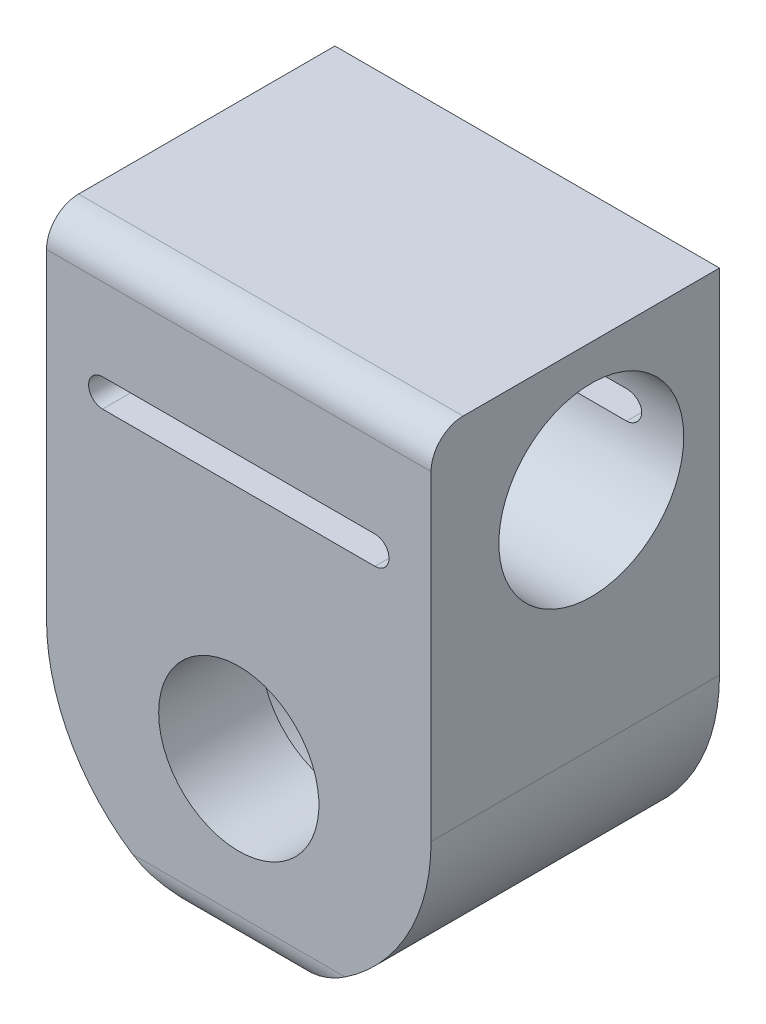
ISO-10303-21;
HEADER;
FILE_DESCRIPTION(('STEP AP214'),'2;1');
FILE_NAME('part.step','',(''),(''),'','','');
FILE_SCHEMA(('AUTOMOTIVE_DESIGN { 1 0 10303 214 1 1 1 1 }'));
ENDSEC;
DATA;
#1=APPLICATION_CONTEXT('core data for automotive mechanical design processes');
#2=APPLICATION_PROTOCOL_DEFINITION('international standard','automotive_design',2000,#1);
#3=PRODUCT_CONTEXT('',#1,'mechanical');
#4=PRODUCT('Part','Part','',(#3));
#5=PRODUCT_RELATED_PRODUCT_CATEGORY('part','',(#4));
#6=PRODUCT_DEFINITION_FORMATION('','',#4);
#7=PRODUCT_DEFINITION_CONTEXT('part definition',#1,'design');
#8=PRODUCT_DEFINITION('design','',#6,#7);
#9=PRODUCT_DEFINITION_SHAPE('','',#8);
#10=(LENGTH_UNIT() NAMED_UNIT(*) SI_UNIT(.MILLI.,.METRE.));
#11=(NAMED_UNIT(*) PLANE_ANGLE_UNIT() SI_UNIT($,.RADIAN.));
#12=(NAMED_UNIT(*) SI_UNIT($,.STERADIAN.) SOLID_ANGLE_UNIT());
#13=UNCERTAINTY_MEASURE_WITH_UNIT(LENGTH_MEASURE(1.E-05),#10,'distance_accuracy_value','');
#14=(GEOMETRIC_REPRESENTATION_CONTEXT(3) GLOBAL_UNCERTAINTY_ASSIGNED_CONTEXT((#13)) GLOBAL_UNIT_ASSIGNED_CONTEXT((#10,
#11,#12)) REPRESENTATION_CONTEXT('',''));
#15=CARTESIAN_POINT('',(0.,0.,0.));
#16=DIRECTION('',(0.,0.,1.));
#17=DIRECTION('',(1.,0.,0.));
#18=AXIS2_PLACEMENT_3D('',#15,#16,#17);
#19=CARTESIAN_POINT('',(0.,-63.5,114.3));
#20=DIRECTION('',(0.,0.,-1.));
#21=DIRECTION('',(-1.,0.,0.));
#22=AXIS2_PLACEMENT_3D('',#19,#20,#21);
#23=CYLINDRICAL_SURFACE('',#22,76.2);
#24=DIRECTION('',(0.,0.,-1.));
#25=VECTOR('',#24,1.);
#26=CARTESIAN_POINT('',(76.2,-63.5,114.3));
#27=LINE('',#26,#25);
#28=CARTESIAN_POINT('',(76.2,-63.5,114.3));
#29=VERTEX_POINT('',#28);
#30=CARTESIAN_POINT('',(76.2,-63.5,0.));
#31=VERTEX_POINT('',#30);
#32=EDGE_CURVE('E356',#29,#31,#27,.T.);
#33=ORIENTED_EDGE('',*,*,#32,.F.);
#34=CARTESIAN_POINT('',(0.,-63.5,114.3));
#35=DIRECTION('',(0.,0.,-1.));
#36=DIRECTION('',(-1.,0.,0.));
#37=AXIS2_PLACEMENT_3D('',#34,#35,#36);
#38=CIRCLE('',#37,76.2);
#39=CARTESIAN_POINT('',(42.1211348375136,-127.,114.3));
#40=VERTEX_POINT('',#39);
#41=EDGE_CURVE('E358',#40,#29,#38,.F.);
#42=ORIENTED_EDGE('',*,*,#41,.F.);
#43=CARTESIAN_POINT('',(0.,-139.7,101.6));
#44=CARTESIAN_POINT('',(0.0170377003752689,-139.699999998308,101.60695561));
#45=CARTESIAN_POINT('',(0.034075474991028,-139.699994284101,101.613911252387));
#46=CARTESIAN_POINT('',(2.03742847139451,-139.698650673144,102.431776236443));
#47=CARTESIAN_POINT('',(4.0247212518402,-139.619673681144,103.243032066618));
#48=CARTESIAN_POINT('',(7.00250718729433,-139.384106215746,104.444407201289));
#49=CARTESIAN_POINT('',(7.99501216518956,-139.285997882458,104.842452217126));
#50=CARTESIAN_POINT('',(9.97853241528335,-139.050421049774,105.630697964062));
#51=CARTESIAN_POINT('',(10.9695477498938,-138.912954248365,106.020899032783));
#52=CARTESIAN_POINT('',(12.9518201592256,-138.597936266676,106.791490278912));
#53=CARTESIAN_POINT('',(13.9430720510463,-138.420289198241,107.171854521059));
#54=CARTESIAN_POINT('',(15.9228290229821,-138.024643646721,107.918687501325));
#55=CARTESIAN_POINT('',(16.9113339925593,-137.806643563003,108.285155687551));
#56=CARTESIAN_POINT('',(18.884262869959,-137.329899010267,109.000530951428));
#57=CARTESIAN_POINT('',(19.8686886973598,-137.071176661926,109.349447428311));
#58=CARTESIAN_POINT('',(21.832988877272,-136.512349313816,110.026012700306));
#59=CARTESIAN_POINT('',(22.8128637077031,-136.212248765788,110.353663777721));
#60=CARTESIAN_POINT('',(24.9771687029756,-135.500990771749,111.051020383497));
#61=CARTESIAN_POINT('',(26.1603021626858,-135.079826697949,111.414630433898));
#62=CARTESIAN_POINT('',(28.5161425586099,-134.17433455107,112.094740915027));
#63=CARTESIAN_POINT('',(29.6888497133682,-133.690007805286,112.411242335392));
#64=CARTESIAN_POINT('',(31.434291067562,-132.917055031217,112.841203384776));
#65=CARTESIAN_POINT('',(32.0123214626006,-132.65242230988,112.976758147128));
#66=CARTESIAN_POINT('',(33.1644541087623,-132.107324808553,113.231671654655));
#67=CARTESIAN_POINT('',(33.7385566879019,-131.826861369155,113.351031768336));
#68=CARTESIAN_POINT('',(34.8822425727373,-131.250123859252,113.571707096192));
#69=CARTESIAN_POINT('',(35.4518261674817,-130.953850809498,113.673023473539));
#70=CARTESIAN_POINT('',(36.5857689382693,-130.345608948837,113.855517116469));
#71=CARTESIAN_POINT('',(37.1501285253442,-130.03364138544,113.93669597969));
#72=CARTESIAN_POINT('',(38.451388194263,-129.292519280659,114.098820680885));
#73=CARTESIAN_POINT('',(39.1860955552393,-128.857642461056,114.171485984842));
#74=CARTESIAN_POINT('',(40.6424150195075,-127.962112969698,114.271512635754));
#75=CARTESIAN_POINT('',(41.3640344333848,-127.501475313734,114.298900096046));
#76=CARTESIAN_POINT('',(42.4374430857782,-126.790519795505,114.300505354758));
#77=CARTESIAN_POINT('',(42.7952115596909,-126.549155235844,114.294352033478));
#78=CARTESIAN_POINT('',(43.5062227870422,-126.060647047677,114.267575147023));
#79=CARTESIAN_POINT('',(43.8594658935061,-125.813503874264,114.246952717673));
#80=CARTESIAN_POINT('',(44.5614700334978,-125.313439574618,114.190034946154));
#81=CARTESIAN_POINT('',(44.9102226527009,-125.06050953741,114.153713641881));
#82=CARTESIAN_POINT('',(45.6020762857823,-124.549782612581,114.064089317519));
#83=CARTESIAN_POINT('',(45.9451756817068,-124.291984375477,114.010781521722));
#84=CARTESIAN_POINT('',(46.2850648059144,-124.032080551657,113.948338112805));
#85=B_SPLINE_CURVE_WITH_KNOTS('',3,(#43,#44,#45,#46,#47,#48,#49,#50,#51,#52,#53,#54,#55,#56,#57,
#58,#59,#60,#61,#62,#63,#64,#65,#66,#67,#68,#69,#70,#71,#72,#73,#74,#75,#76,#77,#78,#79,#80,#81,
#82,#83,#84),.UNSPECIFIED.,.F.,.F.,(4,2,2,2,2,2,2,2,2,2,2,2,2,2,2,2,2,2,2,2,4),(0.,
0.0552086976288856,6.49157800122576,9.71259317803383,12.9334694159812,16.162114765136,
19.3908882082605,22.6179137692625,25.8445924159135,29.7647298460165,33.6847849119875,
35.6345088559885,37.5840679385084,39.5335012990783,41.4827799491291,44.051827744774,
46.6193933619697,47.9139912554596,49.2084875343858,50.5051328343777,51.8021430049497),.UNSPECIFIED.);
#86=CARTESIAN_POINT('',(0.,-139.7,101.6));
#87=VERTEX_POINT('',#86);
#88=EDGE_CURVE('E364',#87,#40,#85,.T.);
#89=ORIENTED_EDGE('',*,*,#88,.F.);
#90=DIRECTION('',(0.,0.,1.));
#91=VECTOR('',#90,1.);
#92=CARTESIAN_POINT('',(0.,-139.7,114.3));
#93=LINE('',#92,#91);
#94=CARTESIAN_POINT('',(0.,-139.7,0.));
#95=VERTEX_POINT('',#94);
#96=EDGE_CURVE('E273',#87,#95,#93,.F.);
#97=ORIENTED_EDGE('',*,*,#96,.T.);
#98=CARTESIAN_POINT('',(0.,-63.5,0.));
#99=DIRECTION('',(0.,0.,-1.));
#100=DIRECTION('',(-1.,0.,0.));
#101=AXIS2_PLACEMENT_3D('',#98,#99,#100);
#102=CIRCLE('',#101,76.2);
#103=EDGE_CURVE('E361',#31,#95,#102,.T.);
#104=ORIENTED_EDGE('',*,*,#103,.F.);
#105=EDGE_LOOP('',(#33,#42,#89,#97,#104));
#106=FACE_BOUND('',#105,.T.);
#107=ADVANCED_FACE('F51',(#106),#23,.T.);
#108=CARTESIAN_POINT('',(0.,-63.5,114.3));
#109=DIRECTION('',(0.,0.,1.));
#110=DIRECTION('',(1.,0.,0.));
#111=AXIS2_PLACEMENT_3D('',#108,#109,#110);
#112=CYLINDRICAL_SURFACE('',#111,76.2);
#113=DIRECTION('',(0.,0.,1.));
#114=VECTOR('',#113,1.);
#115=CARTESIAN_POINT('',(-76.2,-63.5,114.3));
#116=LINE('',#115,#114);
#117=CARTESIAN_POINT('',(-76.2,-63.5,0.));
#118=VERTEX_POINT('',#117);
#119=CARTESIAN_POINT('',(-76.2,-63.5,114.3));
#120=VERTEX_POINT('',#119);
#121=EDGE_CURVE('E260',#118,#120,#116,.T.);
#122=ORIENTED_EDGE('',*,*,#121,.F.);
#123=CARTESIAN_POINT('',(0.,-63.5,0.));
#124=DIRECTION('',(0.,0.,-1.));
#125=DIRECTION('',(-1.,0.,0.));
#126=AXIS2_PLACEMENT_3D('',#123,#124,#125);
#127=CIRCLE('',#126,76.2);
#128=EDGE_CURVE('E365',#95,#118,#127,.T.);
#129=ORIENTED_EDGE('',*,*,#128,.F.);
#130=ORIENTED_EDGE('',*,*,#96,.F.);
#131=CARTESIAN_POINT('',(-42.1211348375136,-127.,114.3));
#132=CARTESIAN_POINT('',(-41.6720587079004,-127.29789461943,114.299965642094));
#133=CARTESIAN_POINT('',(-41.2198731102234,-127.590969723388,114.28952012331));
#134=CARTESIAN_POINT('',(-40.3101054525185,-128.167030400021,114.249568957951));
#135=CARTESIAN_POINT('',(-39.8525248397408,-128.450018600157,114.220068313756));
#136=CARTESIAN_POINT('',(-38.9332683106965,-129.005179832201,114.143826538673));
#137=CARTESIAN_POINT('',(-38.4715998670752,-129.277368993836,114.097112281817));
#138=CARTESIAN_POINT('',(-37.5440212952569,-129.811182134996,113.987956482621));
#139=CARTESIAN_POINT('',(-37.0781108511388,-130.072805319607,113.925513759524));
#140=CARTESIAN_POINT('',(-35.6797528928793,-130.838849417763,113.717444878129));
#141=CARTESIAN_POINT('',(-34.7416983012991,-131.327449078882,113.550634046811));
#142=CARTESIAN_POINT('',(-32.8535333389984,-132.26187942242,113.1696716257));
#143=CARTESIAN_POINT('',(-31.9034162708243,-132.707685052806,112.955492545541));
#144=CARTESIAN_POINT('',(-30.0591378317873,-133.527393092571,112.503527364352));
#145=CARTESIAN_POINT('',(-29.1655879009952,-133.904127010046,112.268353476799));
#146=CARTESIAN_POINT('',(-27.3717723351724,-134.620736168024,111.768833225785));
#147=CARTESIAN_POINT('',(-26.4715056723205,-134.960605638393,111.504482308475));
#148=CARTESIAN_POINT('',(-24.6651294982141,-135.604029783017,110.950980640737));
#149=CARTESIAN_POINT('',(-23.7590172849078,-135.907566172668,110.661817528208));
#150=CARTESIAN_POINT('',(-21.9424144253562,-136.478606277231,110.06269851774));
#151=CARTESIAN_POINT('',(-21.0319239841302,-136.746111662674,109.752743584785));
#152=CARTESIAN_POINT('',(-19.2043072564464,-137.246424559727,109.114371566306));
#153=CARTESIAN_POINT('',(-18.287168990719,-137.479114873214,108.785897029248));
#154=CARTESIAN_POINT('',(-16.449978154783,-137.909195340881,108.114474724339));
#155=CARTESIAN_POINT('',(-15.5299255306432,-138.106584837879,107.771526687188));
#156=CARTESIAN_POINT('',(-12.7671742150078,-138.646255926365,106.725469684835));
#157=CARTESIAN_POINT('',(-10.9206651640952,-138.936371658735,106.004715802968));
#158=CARTESIAN_POINT('',(-7.56935550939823,-139.338215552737,104.67359254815));
#159=CARTESIAN_POINT('',(-6.06537250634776,-139.47318636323,104.067852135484));
#160=CARTESIAN_POINT('',(-3.05785098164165,-139.653493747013,102.848321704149));
#161=CARTESIAN_POINT('',(-1.55431566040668,-139.698974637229,102.234546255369));
#162=CARTESIAN_POINT('',(-0.0340755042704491,-139.699994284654,101.613911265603));
#163=CARTESIAN_POINT('',(-0.0170377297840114,-139.699999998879,101.60695562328));
#164=CARTESIAN_POINT('',(0.,-139.7,101.6));
#165=B_SPLINE_CURVE_WITH_KNOTS('',3,(#131,#132,#133,#134,#135,#136,#137,#138,#139,#140,#141,
#142,#143,#144,#145,#146,#147,#148,#149,#150,#151,#152,#153,#154,#155,#156,#157,#158,#159,#160,
#161,#162,#163,#164),.UNSPECIFIED.,.F.,.F.,(4,2,2,2,2,2,2,2,2,2,2,2,2,2,2,2,4),(0.,
1.61645535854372,3.23248653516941,4.84600536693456,6.45964536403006,9.66946355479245,
12.8811494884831,15.8734327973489,18.8661837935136,21.8604346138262,24.8545465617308,
27.8585211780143,30.8625517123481,36.8666229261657,41.7454171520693,46.6163370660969,
46.6715457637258),.UNSPECIFIED.);
#166=CARTESIAN_POINT('',(-42.1211348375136,-127.,114.3));
#167=VERTEX_POINT('',#166);
#168=EDGE_CURVE('E266',#167,#87,#165,.T.);
#169=ORIENTED_EDGE('',*,*,#168,.F.);
#170=CARTESIAN_POINT('',(0.,-63.5,114.3));
#171=DIRECTION('',(0.,0.,-1.));
#172=DIRECTION('',(-1.,0.,0.));
#173=AXIS2_PLACEMENT_3D('',#170,#171,#172);
#174=CIRCLE('',#173,76.2);
#175=EDGE_CURVE('E263',#120,#167,#174,.F.);
#176=ORIENTED_EDGE('',*,*,#175,.F.);
#177=EDGE_LOOP('',(#122,#129,#130,#169,#176));
#178=FACE_BOUND('',#177,.T.);
#179=ADVANCED_FACE('F278',(#178),#112,.T.);
#180=CARTESIAN_POINT('',(0.,-73.152,114.3));
#181=DIRECTION('',(0.,0.,-1.));
#182=DIRECTION('',(-1.,0.,0.));
#183=AXIS2_PLACEMENT_3D('',#180,#181,#182);
#184=CYLINDRICAL_SURFACE('',#183,31.75);
#185=CARTESIAN_POINT('',(0.,-73.152,114.3));
#186=DIRECTION('',(0.,0.,-1.));
#187=DIRECTION('',(-1.,0.,0.));
#188=AXIS2_PLACEMENT_3D('',#185,#186,#187);
#189=CIRCLE('',#188,31.75);
#190=CARTESIAN_POINT('',(-31.75,-73.152,114.3));
#191=VERTEX_POINT('',#190);
#192=EDGE_CURVE('E218',#191,#191,#189,.T.);
#193=ORIENTED_EDGE('',*,*,#192,.F.);
#194=EDGE_LOOP('',(#193));
#195=FACE_BOUND('',#194,.T.);
#196=CARTESIAN_POINT('',(0.,-73.152,73.66));
#197=DIRECTION('',(0.,0.,-1.));
#198=DIRECTION('',(-1.,0.,0.));
#199=AXIS2_PLACEMENT_3D('',#196,#197,#198);
#200=CIRCLE('',#199,31.75);
#201=CARTESIAN_POINT('',(-31.75,-73.152,73.66));
#202=VERTEX_POINT('',#201);
#203=EDGE_CURVE('E217',#202,#202,#200,.F.);
#204=ORIENTED_EDGE('',*,*,#203,.F.);
#205=EDGE_LOOP('',(#204));
#206=FACE_BOUND('',#205,.T.);
#207=ADVANCED_FACE('F282',(#195,#206),#184,.F.);
#208=CARTESIAN_POINT('',(-76.2,-139.7,114.3));
#209=DIRECTION('',(1.,0.,0.));
#210=DIRECTION('',(0.,0.,-1.));
#211=AXIS2_PLACEMENT_3D('',#208,#209,#210);
#212=PLANE('',#211);
#213=CARTESIAN_POINT('',(-76.2,25.4,50.8));
#214=DIRECTION('',(1.,0.,0.));
#215=DIRECTION('',(0.,0.,-1.));
#216=AXIS2_PLACEMENT_3D('',#213,#214,#215);
#217=CIRCLE('',#216,36.6395);
#218=CARTESIAN_POINT('',(-76.2,25.4,14.1605));
#219=VERTEX_POINT('',#218);
#220=EDGE_CURVE('E224',#219,#219,#217,.T.);
#221=ORIENTED_EDGE('',*,*,#220,.T.);
#222=EDGE_LOOP('',(#221));
#223=FACE_BOUND('',#222,.T.);
#224=DIRECTION('',(0.,-1.,0.));
#225=VECTOR('',#224,1.);
#226=CARTESIAN_POINT('',(-76.2,-139.7,0.));
#227=LINE('',#226,#225);
#228=CARTESIAN_POINT('',(-76.2,76.2,0.));
#229=VERTEX_POINT('',#228);
#230=EDGE_CURVE('E227',#229,#118,#227,.T.);
#231=ORIENTED_EDGE('',*,*,#230,.T.);
#232=ORIENTED_EDGE('',*,*,#121,.T.);
#233=DIRECTION('',(0.,-1.,0.));
#234=VECTOR('',#233,1.);
#235=CARTESIAN_POINT('',(-76.2,-139.7,114.3));
#236=LINE('',#235,#234);
#237=CARTESIAN_POINT('',(-76.2,63.5,114.3));
#238=VERTEX_POINT('',#237);
#239=EDGE_CURVE('E235',#238,#120,#236,.T.);
#240=ORIENTED_EDGE('',*,*,#239,.F.);
#241=CARTESIAN_POINT('',(-76.2,63.5,101.6));
#242=DIRECTION('',(1.,0.,0.));
#243=DIRECTION('',(0.,0.,-1.));
#244=AXIS2_PLACEMENT_3D('',#241,#242,#243);
#245=CIRCLE('',#244,12.7);
#246=CARTESIAN_POINT('',(-76.2,76.2,101.6));
#247=VERTEX_POINT('',#246);
#248=EDGE_CURVE('E250',#238,#247,#245,.F.);
#249=ORIENTED_EDGE('',*,*,#248,.T.);
#250=DIRECTION('',(0.,0.,-1.));
#251=VECTOR('',#250,1.);
#252=CARTESIAN_POINT('',(-76.2,76.2,114.3));
#253=LINE('',#252,#251);
#254=EDGE_CURVE('E240',#247,#229,#253,.T.);
#255=ORIENTED_EDGE('',*,*,#254,.T.);
#256=EDGE_LOOP('',(#231,#232,#240,#249,#255));
#257=FACE_BOUND('',#256,.T.);
#258=ADVANCED_FACE('F284',(#223,#257),#212,.F.);
#259=CARTESIAN_POINT('',(76.2,-139.7,114.3));
#260=DIRECTION('',(-1.,0.,0.));
#261=DIRECTION('',(0.,0.,1.));
#262=AXIS2_PLACEMENT_3D('',#259,#260,#261);
#263=PLANE('',#262);
#264=CARTESIAN_POINT('',(76.2,25.4,50.8));
#265=DIRECTION('',(1.,0.,0.));
#266=DIRECTION('',(0.,0.,-1.));
#267=AXIS2_PLACEMENT_3D('',#264,#265,#266);
#268=CIRCLE('',#267,36.6395);
#269=CARTESIAN_POINT('',(76.2,25.4,14.1605));
#270=VERTEX_POINT('',#269);
#271=EDGE_CURVE('E221',#270,#270,#268,.T.);
#272=ORIENTED_EDGE('',*,*,#271,.F.);
#273=EDGE_LOOP('',(#272));
#274=FACE_BOUND('',#273,.T.);
#275=DIRECTION('',(0.,1.,0.));
#276=VECTOR('',#275,1.);
#277=CARTESIAN_POINT('',(76.2,-139.7,114.3));
#278=LINE('',#277,#276);
#279=CARTESIAN_POINT('',(76.2,63.5,114.3));
#280=VERTEX_POINT('',#279);
#281=EDGE_CURVE('E238',#29,#280,#278,.T.);
#282=ORIENTED_EDGE('',*,*,#281,.F.);
#283=ORIENTED_EDGE('',*,*,#32,.T.);
#284=DIRECTION('',(0.,1.,0.));
#285=VECTOR('',#284,1.);
#286=CARTESIAN_POINT('',(76.2,-139.7,0.));
#287=LINE('',#286,#285);
#288=CARTESIAN_POINT('',(76.2,76.2,0.));
#289=VERTEX_POINT('',#288);
#290=EDGE_CURVE('E230',#31,#289,#287,.T.);
#291=ORIENTED_EDGE('',*,*,#290,.T.);
#292=DIRECTION('',(0.,0.,-1.));
#293=VECTOR('',#292,1.);
#294=CARTESIAN_POINT('',(76.2,76.2,114.3));
#295=LINE('',#294,#293);
#296=CARTESIAN_POINT('',(76.2,76.2,101.6));
#297=VERTEX_POINT('',#296);
#298=EDGE_CURVE('E242',#297,#289,#295,.T.);
#299=ORIENTED_EDGE('',*,*,#298,.F.);
#300=CARTESIAN_POINT('',(76.2,63.5,101.6));
#301=DIRECTION('',(-1.,0.,0.));
#302=DIRECTION('',(0.,0.,1.));
#303=AXIS2_PLACEMENT_3D('',#300,#301,#302);
#304=CIRCLE('',#303,12.7);
#305=EDGE_CURVE('E254',#297,#280,#304,.F.);
#306=ORIENTED_EDGE('',*,*,#305,.T.);
#307=EDGE_LOOP('',(#282,#283,#291,#299,#306));
#308=FACE_BOUND('',#307,.T.);
#309=ADVANCED_FACE('F287',(#274,#308),#263,.F.);
#310=CARTESIAN_POINT('',(-76.2,76.2,114.3));
#311=DIRECTION('',(0.,-1.,0.));
#312=DIRECTION('',(0.,0.,-1.));
#313=AXIS2_PLACEMENT_3D('',#310,#311,#312);
#314=PLANE('',#313);
#315=ORIENTED_EDGE('',*,*,#254,.F.);
#316=DIRECTION('',(-1.,0.,0.));
#317=VECTOR('',#316,1.);
#318=CARTESIAN_POINT('',(-76.2,76.2,101.6));
#319=LINE('',#318,#317);
#320=EDGE_CURVE('E252',#247,#297,#319,.F.);
#321=ORIENTED_EDGE('',*,*,#320,.T.);
#322=ORIENTED_EDGE('',*,*,#298,.T.);
#323=DIRECTION('',(-1.,0.,0.));
#324=VECTOR('',#323,1.);
#325=CARTESIAN_POINT('',(-76.2,76.2,0.));
#326=LINE('',#325,#324);
#327=EDGE_CURVE('E232',#289,#229,#326,.T.);
#328=ORIENTED_EDGE('',*,*,#327,.T.);
#329=EDGE_LOOP('',(#315,#321,#322,#328));
#330=FACE_BOUND('',#329,.T.);
#331=ADVANCED_FACE('F291',(#330),#314,.F.);
#332=CARTESIAN_POINT('',(-76.2,76.2,114.3));
#333=DIRECTION('',(0.,0.,-1.));
#334=DIRECTION('',(-1.,0.,0.));
#335=AXIS2_PLACEMENT_3D('',#332,#333,#334);
#336=PLANE('',#335);
#337=DIRECTION('',(1.,0.,0.));
#338=VECTOR('',#337,1.);
#339=CARTESIAN_POINT('',(-53.975,19.8501,114.3));
#340=LINE('',#339,#338);
#341=CARTESIAN_POINT('',(-53.975,19.8501,114.3));
#342=VERTEX_POINT('',#341);
#343=CARTESIAN_POINT('',(53.975,19.8501,114.3));
#344=VERTEX_POINT('',#343);
#345=EDGE_CURVE('E179',#342,#344,#340,.T.);
#346=ORIENTED_EDGE('',*,*,#345,.F.);
#347=CARTESIAN_POINT('',(-53.975,25.4,114.3));
#348=DIRECTION('',(0.,0.,1.));
#349=DIRECTION('',(1.,0.,0.));
#350=AXIS2_PLACEMENT_3D('',#347,#348,#349);
#351=CIRCLE('',#350,5.54989999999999);
#352=CARTESIAN_POINT('',(-53.975,30.9499,114.3));
#353=VERTEX_POINT('',#352);
#354=EDGE_CURVE('E70',#353,#342,#351,.T.);
#355=ORIENTED_EDGE('',*,*,#354,.F.);
#356=DIRECTION('',(-1.,0.,0.));
#357=VECTOR('',#356,1.);
#358=CARTESIAN_POINT('',(53.975,30.9499,114.3));
#359=LINE('',#358,#357);
#360=CARTESIAN_POINT('',(53.975,30.9499,114.3));
#361=VERTEX_POINT('',#360);
#362=EDGE_CURVE('E187',#361,#353,#359,.T.);
#363=ORIENTED_EDGE('',*,*,#362,.F.);
#364=CARTESIAN_POINT('',(53.975,25.4,114.3));
#365=DIRECTION('',(0.,0.,1.));
#366=DIRECTION('',(1.,0.,0.));
#367=AXIS2_PLACEMENT_3D('',#364,#365,#366);
#368=CIRCLE('',#367,5.5499);
#369=EDGE_CURVE('E169',#344,#361,#368,.T.);
#370=ORIENTED_EDGE('',*,*,#369,.F.);
#371=EDGE_LOOP('',(#346,#355,#363,#370));
#372=FACE_BOUND('',#371,.T.);
#373=ORIENTED_EDGE('',*,*,#192,.T.);
#374=EDGE_LOOP('',(#373));
#375=FACE_BOUND('',#374,.T.);
#376=DIRECTION('',(1.,0.,0.));
#377=VECTOR('',#376,1.);
#378=CARTESIAN_POINT('',(-76.2,-127.,114.3));
#379=LINE('',#378,#377);
#380=EDGE_CURVE('E257',#167,#40,#379,.T.);
#381=ORIENTED_EDGE('',*,*,#380,.T.);
#382=ORIENTED_EDGE('',*,*,#41,.T.);
#383=ORIENTED_EDGE('',*,*,#281,.T.);
#384=DIRECTION('',(-1.,0.,0.));
#385=VECTOR('',#384,1.);
#386=CARTESIAN_POINT('',(-76.2,63.5,114.3));
#387=LINE('',#386,#385);
#388=EDGE_CURVE('E245',#280,#238,#387,.T.);
#389=ORIENTED_EDGE('',*,*,#388,.T.);
#390=ORIENTED_EDGE('',*,*,#239,.T.);
#391=ORIENTED_EDGE('',*,*,#175,.T.);
#392=EDGE_LOOP('',(#381,#382,#383,#389,#390,#391));
#393=FACE_BOUND('',#392,.T.);
#394=ADVANCED_FACE('F184',(#372,#375,#393),#336,.F.);
#395=CARTESIAN_POINT('',(-76.2,76.2,0.));
#396=DIRECTION('',(0.,0.,-1.));
#397=DIRECTION('',(-1.,0.,0.));
#398=AXIS2_PLACEMENT_3D('',#395,#396,#397);
#399=PLANE('',#398);
#400=CARTESIAN_POINT('',(-53.975,25.4,0.));
#401=DIRECTION('',(0.,0.,1.));
#402=DIRECTION('',(1.,0.,0.));
#403=AXIS2_PLACEMENT_3D('',#400,#401,#402);
#404=CIRCLE('',#403,5.54989999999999);
#405=CARTESIAN_POINT('',(-53.975,30.9499,0.));
#406=VERTEX_POINT('',#405);
#407=CARTESIAN_POINT('',(-53.975,19.8501,0.));
#408=VERTEX_POINT('',#407);
#409=EDGE_CURVE('E189',#406,#408,#404,.T.);
#410=ORIENTED_EDGE('',*,*,#409,.T.);
#411=DIRECTION('',(1.,0.,0.));
#412=VECTOR('',#411,1.);
#413=CARTESIAN_POINT('',(-53.975,19.8501,0.));
#414=LINE('',#413,#412);
#415=CARTESIAN_POINT('',(53.975,19.8501,0.));
#416=VERTEX_POINT('',#415);
#417=EDGE_CURVE('E195',#408,#416,#414,.T.);
#418=ORIENTED_EDGE('',*,*,#417,.T.);
#419=CARTESIAN_POINT('',(53.975,25.4,0.));
#420=DIRECTION('',(0.,0.,1.));
#421=DIRECTION('',(1.,0.,0.));
#422=AXIS2_PLACEMENT_3D('',#419,#420,#421);
#423=CIRCLE('',#422,5.5499);
#424=CARTESIAN_POINT('',(53.975,30.9499,0.));
#425=VERTEX_POINT('',#424);
#426=EDGE_CURVE('E78',#416,#425,#423,.T.);
#427=ORIENTED_EDGE('',*,*,#426,.T.);
#428=DIRECTION('',(-1.,0.,0.));
#429=VECTOR('',#428,1.);
#430=CARTESIAN_POINT('',(53.975,30.9499,0.));
#431=LINE('',#430,#429);
#432=EDGE_CURVE('E199',#425,#406,#431,.T.);
#433=ORIENTED_EDGE('',*,*,#432,.T.);
#434=EDGE_LOOP('',(#410,#418,#427,#433));
#435=FACE_BOUND('',#434,.T.);
#436=CARTESIAN_POINT('',(0.,-73.152,0.));
#437=DIRECTION('',(0.,0.,-1.));
#438=DIRECTION('',(-1.,0.,0.));
#439=AXIS2_PLACEMENT_3D('',#436,#437,#438);
#440=CIRCLE('',#439,55.0545);
#441=CARTESIAN_POINT('',(-55.0545,-73.152,0.));
#442=VERTEX_POINT('',#441);
#443=EDGE_CURVE('E205',#442,#442,#440,.T.);
#444=ORIENTED_EDGE('',*,*,#443,.F.);
#445=EDGE_LOOP('',(#444));
#446=FACE_BOUND('',#445,.T.);
#447=ORIENTED_EDGE('',*,*,#290,.F.);
#448=ORIENTED_EDGE('',*,*,#103,.T.);
#449=ORIENTED_EDGE('',*,*,#128,.T.);
#450=ORIENTED_EDGE('',*,*,#230,.F.);
#451=ORIENTED_EDGE('',*,*,#327,.F.);
#452=EDGE_LOOP('',(#447,#448,#449,#450,#451));
#453=FACE_BOUND('',#452,.T.);
#454=ADVANCED_FACE('F298',(#435,#446,#453),#399,.T.);
#455=CARTESIAN_POINT('',(-76.2,25.4,50.8));
#456=DIRECTION('',(1.,0.,0.));
#457=DIRECTION('',(0.,0.,-1.));
#458=AXIS2_PLACEMENT_3D('',#455,#456,#457);
#459=CYLINDRICAL_SURFACE('',#458,36.6395);
#460=DIRECTION('',(1.,0.,0.));
#461=VECTOR('',#460,1.);
#462=CARTESIAN_POINT('',(-76.2,19.8501,14.5832694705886));
#463=LINE('',#462,#461);
#464=CARTESIAN_POINT('',(53.975,19.8501,14.5832694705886));
#465=VERTEX_POINT('',#464);
#466=CARTESIAN_POINT('',(-53.975,19.8501,14.5832694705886));
#467=VERTEX_POINT('',#466);
#468=EDGE_CURVE('E327',#465,#467,#463,.F.);
#469=ORIENTED_EDGE('',*,*,#468,.T.);
#470=CARTESIAN_POINT('',(-59.5249,25.4,14.1605));
#471=CARTESIAN_POINT('',(-59.5249021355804,25.5549729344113,14.1604991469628));
#472=CARTESIAN_POINT('',(-59.5184067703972,25.7099160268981,14.1614850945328));
#473=CARTESIAN_POINT('',(-59.4924774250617,26.0187393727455,14.1653995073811));
#474=CARTESIAN_POINT('',(-59.4730407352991,26.1726193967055,14.1683283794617));
#475=CARTESIAN_POINT('',(-59.4213541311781,26.478267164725,14.1760502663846));
#476=CARTESIAN_POINT('',(-59.3890955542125,26.6300334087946,14.1808445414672));
#477=CARTESIAN_POINT('',(-59.3119954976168,26.9303291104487,14.1921642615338));
#478=CARTESIAN_POINT('',(-59.2671494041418,27.0788573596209,14.1986903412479));
#479=CARTESIAN_POINT('',(-59.1652714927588,27.3714045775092,14.2132817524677));
#480=CARTESIAN_POINT('',(-59.1082536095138,27.5154284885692,14.2213453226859));
#481=CARTESIAN_POINT('',(-58.9823956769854,27.7981944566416,14.23879516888));
#482=CARTESIAN_POINT('',(-58.9135512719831,27.9369345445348,14.2481819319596));
#483=CARTESIAN_POINT('',(-58.7645881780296,28.2080502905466,14.2680101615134));
#484=CARTESIAN_POINT('',(-58.6844753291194,28.3404291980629,14.2784510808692));
#485=CARTESIAN_POINT('',(-58.5134821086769,28.5980431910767,14.3001068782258));
#486=CARTESIAN_POINT('',(-58.4225977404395,28.7232755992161,14.311322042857));
#487=CARTESIAN_POINT('',(-58.2300683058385,28.9665113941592,14.3342903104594));
#488=CARTESIAN_POINT('',(-58.1283547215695,29.0844602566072,14.3460465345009));
#489=CARTESIAN_POINT('',(-57.9153466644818,29.3114306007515,14.3697008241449));
#490=CARTESIAN_POINT('',(-57.8040486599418,29.4204487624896,14.3815989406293));
#491=CARTESIAN_POINT('',(-57.5727084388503,29.6287232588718,14.4051948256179));
#492=CARTESIAN_POINT('',(-57.4526689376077,29.7279826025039,14.4168926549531));
#493=CARTESIAN_POINT('',(-57.204596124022,29.9161202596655,14.4397661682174));
#494=CARTESIAN_POINT('',(-57.0765598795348,30.0049947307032,14.4509416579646));
#495=CARTESIAN_POINT('',(-56.8127997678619,30.1720819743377,14.4724990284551));
#496=CARTESIAN_POINT('',(-56.6770427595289,30.2502429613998,14.4828769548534));
#497=CARTESIAN_POINT('',(-56.3992939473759,30.3948691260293,14.502485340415));
#498=CARTESIAN_POINT('',(-56.2572998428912,30.4613299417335,14.5117153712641));
#499=CARTESIAN_POINT('',(-55.9681729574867,30.5820041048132,14.5287508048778));
#500=CARTESIAN_POINT('',(-55.821042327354,30.6362225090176,14.536556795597));
#501=CARTESIAN_POINT('',(-55.5226400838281,30.7320545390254,14.5505246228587));
#502=CARTESIAN_POINT('',(-55.371366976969,30.7736635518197,14.5566858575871));
#503=CARTESIAN_POINT('',(-54.9154006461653,30.8784619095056,14.5723219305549));
#504=CARTESIAN_POINT('',(-54.6060067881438,30.9226844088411,14.5791043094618));
#505=CARTESIAN_POINT('',(-53.9842906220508,30.9586322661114,14.5846046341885));
#506=CARTESIAN_POINT('',(-53.6719684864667,30.9503606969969,14.5833230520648));
#507=CARTESIAN_POINT('',(-53.055843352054,30.8819474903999,14.5729055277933));
#508=CARTESIAN_POINT('',(-52.7519906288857,30.8222453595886,14.5638361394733));
#509=CARTESIAN_POINT('',(-52.1586776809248,30.6533353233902,14.5389651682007));
#510=CARTESIAN_POINT('',(-51.8692178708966,30.5441259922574,14.5231633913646));
#511=CARTESIAN_POINT('',(-51.3115570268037,30.2788502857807,14.4865356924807));
#512=CARTESIAN_POINT('',(-51.0434457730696,30.1225980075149,14.4656899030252));
#513=CARTESIAN_POINT('',(-50.5370823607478,29.7678028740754,14.4213370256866));
#514=CARTESIAN_POINT('',(-50.2988322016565,29.569257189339,14.3978297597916));
#515=CARTESIAN_POINT('',(-49.8564052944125,29.1330998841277,14.3505086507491));
#516=CARTESIAN_POINT('',(-49.6526009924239,28.8951103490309,14.3266941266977));
#517=CARTESIAN_POINT('',(-49.2877686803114,28.3881080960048,14.2816644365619));
#518=CARTESIAN_POINT('',(-49.1267408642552,28.1190952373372,14.2604492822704));
#519=CARTESIAN_POINT('',(-48.8520120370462,27.5573575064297,14.2229859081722));
#520=CARTESIAN_POINT('',(-48.7383401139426,27.2646181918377,14.2067407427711));
#521=CARTESIAN_POINT('',(-48.5618754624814,26.663904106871,14.1810731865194));
#522=CARTESIAN_POINT('',(-48.4990792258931,26.3559303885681,14.1716503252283));
#523=CARTESIAN_POINT('',(-48.4266445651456,25.7367038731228,14.1607514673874));
#524=CARTESIAN_POINT('',(-48.4164941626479,25.4255122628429,14.1591989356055));
#525=CARTESIAN_POINT('',(-48.4482798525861,24.8058710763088,14.1640072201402));
#526=CARTESIAN_POINT('',(-48.4902142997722,24.4974214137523,14.170367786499));
#527=CARTESIAN_POINT('',(-48.6245535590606,23.893573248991,14.1902402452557));
#528=CARTESIAN_POINT('',(-48.7167085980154,23.5981179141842,14.2037167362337));
#529=CARTESIAN_POINT('',(-48.948609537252,23.0268516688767,14.2363149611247));
#530=CARTESIAN_POINT('',(-49.0883577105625,22.7510416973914,14.2554369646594));
#531=CARTESIAN_POINT('',(-49.4126764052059,22.2246464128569,14.2973917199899));
#532=CARTESIAN_POINT('',(-49.5975712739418,21.9742630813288,14.3202509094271));
#533=CARTESIAN_POINT('',(-50.00648486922,21.5078969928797,14.3670543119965));
#534=CARTESIAN_POINT('',(-50.2305059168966,21.2919162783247,14.3909985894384));
#535=CARTESIAN_POINT('',(-50.7135892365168,20.8986200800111,14.4375167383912));
#536=CARTESIAN_POINT('',(-50.9729325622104,20.7216480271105,14.4600772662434));
#537=CARTESIAN_POINT('',(-51.5179783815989,20.4137823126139,14.5010355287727));
#538=CARTESIAN_POINT('',(-51.8036801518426,20.2828873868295,14.5194333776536));
#539=CARTESIAN_POINT('',(-52.3922552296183,20.0714168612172,14.5498884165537));
#540=CARTESIAN_POINT('',(-52.6950628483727,19.9906613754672,14.5619682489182));
#541=CARTESIAN_POINT('',(-53.310311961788,19.881210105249,14.5784716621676));
#542=CARTESIAN_POINT('',(-53.6227527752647,19.8525106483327,14.5828957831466));
#543=CARTESIAN_POINT('',(-54.0897767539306,19.8491206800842,14.5834216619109));
#544=CARTESIAN_POINT('',(-54.2444619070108,19.8544849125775,14.582596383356));
#545=CARTESIAN_POINT('',(-54.5528068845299,19.8780991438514,14.5789873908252));
#546=CARTESIAN_POINT('',(-54.7064670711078,19.8963443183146,14.5762044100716));
#547=CARTESIAN_POINT('',(-55.0117268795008,19.9455969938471,14.568755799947));
#548=CARTESIAN_POINT('',(-55.1633257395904,19.9766090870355,14.5640894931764));
#549=CARTESIAN_POINT('',(-55.46329429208,20.0511457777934,14.5530120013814));
#550=CARTESIAN_POINT('',(-55.6116651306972,20.0946658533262,14.5466014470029));
#551=CARTESIAN_POINT('',(-55.9041269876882,20.1938791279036,14.5322212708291));
#552=CARTESIAN_POINT('',(-56.0482198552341,20.2495669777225,14.5242523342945));
#553=CARTESIAN_POINT('',(-56.3311462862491,20.372698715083,14.5069832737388));
#554=CARTESIAN_POINT('',(-56.4699817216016,20.4401383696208,14.4976836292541));
#555=CARTESIAN_POINT('',(-56.7415493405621,20.5863335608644,14.4780092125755));
#556=CARTESIAN_POINT('',(-56.8742791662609,20.6650934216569,14.4676340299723));
#557=CARTESIAN_POINT('',(-57.1326310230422,20.8333261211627,14.4461056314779));
#558=CARTESIAN_POINT('',(-57.2582555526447,20.9227951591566,14.4349526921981));
#559=CARTESIAN_POINT('',(-57.5028397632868,21.1128142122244,14.4120590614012));
#560=CARTESIAN_POINT('',(-57.621718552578,21.2134677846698,14.4003135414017));
#561=CARTESIAN_POINT('',(-57.8505493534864,21.4243605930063,14.3766763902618));
#562=CARTESIAN_POINT('',(-57.9605045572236,21.5345963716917,14.3647848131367));
#563=CARTESIAN_POINT('',(-58.1708401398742,21.7639931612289,14.3411778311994));
#564=CARTESIAN_POINT('',(-58.2712147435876,21.8831594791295,14.3294625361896));
#565=CARTESIAN_POINT('',(-58.4615790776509,22.129492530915,14.3065480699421));
#566=CARTESIAN_POINT('',(-58.5515726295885,22.2566562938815,14.2953487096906));
#567=CARTESIAN_POINT('',(-58.7210907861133,22.5189343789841,14.2737103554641));
#568=CARTESIAN_POINT('',(-58.8005492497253,22.6540918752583,14.2632763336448));
#569=CARTESIAN_POINT('',(-58.9477522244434,22.9306566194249,14.2435434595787));
#570=CARTESIAN_POINT('',(-59.0155010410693,23.0720615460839,14.2342441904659));
#571=CARTESIAN_POINT('',(-59.1387756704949,23.3600674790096,14.2170473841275));
#572=CARTESIAN_POINT('',(-59.1943103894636,23.5066646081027,14.2091488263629));
#573=CARTESIAN_POINT('',(-59.2927892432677,23.8040530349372,14.1949718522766));
#574=CARTESIAN_POINT('',(-59.3357361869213,23.9548433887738,14.188693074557));
#575=CARTESIAN_POINT('',(-59.422858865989,24.3185994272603,14.1758524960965));
#576=CARTESIAN_POINT('',(-59.4610813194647,24.5330488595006,14.1701210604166));
#577=CARTESIAN_POINT('',(-59.5121002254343,24.9650184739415,14.1624454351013));
#578=CARTESIAN_POINT('',(-59.5248970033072,25.1825386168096,14.1605011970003));
#579=CARTESIAN_POINT('',(-59.5249,25.4,14.1605));
#580=B_SPLINE_CURVE_WITH_KNOTS('',3,(#470,#471,#472,#473,#474,#475,#476,#477,#478,#479,#480,
#481,#482,#483,#484,#485,#486,#487,#488,#489,#490,#491,#492,#493,#494,#495,#496,#497,#498,#499,
#500,#501,#502,#503,#504,#505,#506,#507,#508,#509,#510,#511,#512,#513,#514,#515,#516,#517,#518,
#519,#520,#521,#522,#523,#524,#525,#526,#527,#528,#529,#530,#531,#532,#533,#534,#535,#536,#537,
#538,#539,#540,#541,#542,#543,#544,#545,#546,#547,#548,#549,#550,#551,#552,#553,#554,#555,#556,
#557,#558,#559,#560,#561,#562,#563,#564,#565,#566,#567,#568,#569,#570,#571,#572,#573,#574,#575,
#576,#577,#578,#579),.UNSPECIFIED.,.T.,.F.,(4,2,2,2,2,2,2,2,2,2,2,2,2,2,2,2,2,2,2,2,2,2,2,2,2,2,
2,2,2,2,2,2,2,2,2,2,2,2,2,2,2,2,2,2,2,2,2,2,2,2,2,2,2,2,4),(0.,0.464728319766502,
0.92955397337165,1.39469420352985,1.86000514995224,2.32478622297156,2.78973884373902,
3.25445137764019,3.71933688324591,4.18736154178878,4.65555940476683,5.12361245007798,
5.59183813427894,6.06225276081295,6.53284238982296,7.0032372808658,7.4738040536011,
8.40673459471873,9.33961052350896,10.264592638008,11.1896013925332,12.118314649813,
13.0470900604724,13.985341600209,14.9235973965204,15.862428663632,16.8011951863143,
17.7308148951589,18.6604052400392,19.585413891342,20.510466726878,21.4423717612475,
22.3743320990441,23.3141958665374,24.2540338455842,25.1904801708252,26.1268604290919,
26.5907495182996,27.0544649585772,27.5183473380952,27.9820622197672,28.4455736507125,
28.9089184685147,29.3724407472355,29.8357990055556,30.3038754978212,30.7717838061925,
31.239972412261,31.7079881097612,32.1788154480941,32.6494692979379,33.1197788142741,
33.5899833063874,34.2421085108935,34.8942253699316),.UNSPECIFIED.);
#581=CARTESIAN_POINT('',(-53.975,30.9499,14.5832694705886));
#582=VERTEX_POINT('',#581);
#583=EDGE_CURVE('E13',#467,#582,#580,.T.);
#584=ORIENTED_EDGE('',*,*,#583,.T.);
#585=DIRECTION('',(1.,0.,0.));
#586=VECTOR('',#585,1.);
#587=CARTESIAN_POINT('',(-76.2,30.9499,14.5832694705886));
#588=LINE('',#587,#586);
#589=CARTESIAN_POINT('',(53.975,30.9499,14.5832694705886));
#590=VERTEX_POINT('',#589);
#591=EDGE_CURVE('E63',#582,#590,#588,.T.);
#592=ORIENTED_EDGE('',*,*,#591,.T.);
#593=CARTESIAN_POINT('',(48.4251,25.4,14.1605));
#594=CARTESIAN_POINT('',(48.4250978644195,25.5549729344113,14.1604991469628));
#595=CARTESIAN_POINT('',(48.4315932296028,25.7099160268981,14.1614850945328));
#596=CARTESIAN_POINT('',(48.4575225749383,26.0187393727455,14.1653995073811));
#597=CARTESIAN_POINT('',(48.4769592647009,26.1726193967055,14.1683283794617));
#598=CARTESIAN_POINT('',(48.5286458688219,26.478267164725,14.1760502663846));
#599=CARTESIAN_POINT('',(48.5609044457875,26.6300334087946,14.1808445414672));
#600=CARTESIAN_POINT('',(48.6380045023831,26.9303291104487,14.1921642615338));
#601=CARTESIAN_POINT('',(48.6828505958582,27.0788573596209,14.1986903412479));
#602=CARTESIAN_POINT('',(48.7847285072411,27.3714045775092,14.2132817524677));
#603=CARTESIAN_POINT('',(48.8417463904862,27.5154284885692,14.2213453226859));
#604=CARTESIAN_POINT('',(48.9676043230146,27.7981944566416,14.23879516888));
#605=CARTESIAN_POINT('',(49.0364487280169,27.9369345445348,14.2481819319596));
#606=CARTESIAN_POINT('',(49.1854118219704,28.2080502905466,14.2680101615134));
#607=CARTESIAN_POINT('',(49.2655246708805,28.3404291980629,14.2784510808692));
#608=CARTESIAN_POINT('',(49.4365178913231,28.5980431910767,14.3001068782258));
#609=CARTESIAN_POINT('',(49.5274022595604,28.7232755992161,14.311322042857));
#610=CARTESIAN_POINT('',(49.7199316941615,28.9665113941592,14.3342903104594));
#611=CARTESIAN_POINT('',(49.8216452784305,29.0844602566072,14.3460465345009));
#612=CARTESIAN_POINT('',(50.0346533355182,29.3114306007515,14.3697008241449));
#613=CARTESIAN_POINT('',(50.1459513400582,29.4204487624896,14.3815989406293));
#614=CARTESIAN_POINT('',(50.3772915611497,29.6287232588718,14.4051948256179));
#615=CARTESIAN_POINT('',(50.4973310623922,29.7279826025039,14.4168926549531));
#616=CARTESIAN_POINT('',(50.745403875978,29.9161202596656,14.4397661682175));
#617=CARTESIAN_POINT('',(50.8734401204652,30.0049947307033,14.4509416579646));
#618=CARTESIAN_POINT('',(51.137200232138,30.1720819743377,14.4724990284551));
#619=CARTESIAN_POINT('',(51.2729572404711,30.2502429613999,14.4828769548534));
#620=CARTESIAN_POINT('',(51.5507060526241,30.3948691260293,14.502485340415));
#621=CARTESIAN_POINT('',(51.6927001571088,30.4613299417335,14.5117153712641));
#622=CARTESIAN_POINT('',(51.9818270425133,30.5820041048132,14.5287508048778));
#623=CARTESIAN_POINT('',(52.1289576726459,30.6362225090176,14.536556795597));
#624=CARTESIAN_POINT('',(52.4273599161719,30.7320545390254,14.5505246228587));
#625=CARTESIAN_POINT('',(52.5786330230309,30.7736635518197,14.5566858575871));
#626=CARTESIAN_POINT('',(53.0345993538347,30.8784619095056,14.5723219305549));
#627=CARTESIAN_POINT('',(53.3439932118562,30.9226844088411,14.5791043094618));
#628=CARTESIAN_POINT('',(53.9657093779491,30.9586322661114,14.5846046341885));
#629=CARTESIAN_POINT('',(54.2780315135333,30.9503606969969,14.5833230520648));
#630=CARTESIAN_POINT('',(54.894156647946,30.8819474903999,14.5729055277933));
#631=CARTESIAN_POINT('',(55.1980093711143,30.8222453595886,14.5638361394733));
#632=CARTESIAN_POINT('',(55.7913223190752,30.6533353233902,14.5389651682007));
#633=CARTESIAN_POINT('',(56.0807821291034,30.5441259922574,14.5231633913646));
#634=CARTESIAN_POINT('',(56.6384429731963,30.2788502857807,14.4865356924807));
#635=CARTESIAN_POINT('',(56.9065542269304,30.1225980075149,14.4656899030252));
#636=CARTESIAN_POINT('',(57.4129176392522,29.7678028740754,14.4213370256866));
#637=CARTESIAN_POINT('',(57.6511677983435,29.569257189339,14.3978297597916));
#638=CARTESIAN_POINT('',(58.0935947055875,29.1330998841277,14.3505086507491));
#639=CARTESIAN_POINT('',(58.2973990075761,28.8951103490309,14.3266941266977));
#640=CARTESIAN_POINT('',(58.6622313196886,28.3881080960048,14.2816644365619));
#641=CARTESIAN_POINT('',(58.8232591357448,28.1190952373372,14.2604492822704));
#642=CARTESIAN_POINT('',(59.0979879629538,27.5573575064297,14.2229859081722));
#643=CARTESIAN_POINT('',(59.2116598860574,27.2646181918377,14.2067407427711));
#644=CARTESIAN_POINT('',(59.3881245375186,26.663904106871,14.1810731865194));
#645=CARTESIAN_POINT('',(59.4509207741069,26.3559303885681,14.1716503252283));
#646=CARTESIAN_POINT('',(59.5233554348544,25.7367038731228,14.1607514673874));
#647=CARTESIAN_POINT('',(59.5335058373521,25.4255122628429,14.1591989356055));
#648=CARTESIAN_POINT('',(59.5017201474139,24.8058710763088,14.1640072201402));
#649=CARTESIAN_POINT('',(59.4597857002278,24.4974214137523,14.170367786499));
#650=CARTESIAN_POINT('',(59.3254464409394,23.893573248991,14.1902402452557));
#651=CARTESIAN_POINT('',(59.2332914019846,23.5981179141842,14.2037167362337));
#652=CARTESIAN_POINT('',(59.001390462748,23.0268516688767,14.2363149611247));
#653=CARTESIAN_POINT('',(58.8616422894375,22.7510416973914,14.2554369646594));
#654=CARTESIAN_POINT('',(58.5373235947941,22.2246464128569,14.2973917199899));
#655=CARTESIAN_POINT('',(58.3524287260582,21.9742630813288,14.3202509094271));
#656=CARTESIAN_POINT('',(57.94351513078,21.5078969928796,14.3670543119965));
#657=CARTESIAN_POINT('',(57.7194940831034,21.2919162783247,14.3909985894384));
#658=CARTESIAN_POINT('',(57.2364107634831,20.8986200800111,14.4375167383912));
#659=CARTESIAN_POINT('',(56.9770674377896,20.7216480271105,14.4600772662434));
#660=CARTESIAN_POINT('',(56.4320216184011,20.4137823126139,14.5010355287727));
#661=CARTESIAN_POINT('',(56.1463198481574,20.2828873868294,14.5194333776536));
#662=CARTESIAN_POINT('',(55.5577447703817,20.0714168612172,14.5498884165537));
#663=CARTESIAN_POINT('',(55.2549371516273,19.9906613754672,14.5619682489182));
#664=CARTESIAN_POINT('',(54.639688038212,19.881210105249,14.5784716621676));
#665=CARTESIAN_POINT('',(54.3272472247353,19.8525106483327,14.5828957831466));
#666=CARTESIAN_POINT('',(53.8602232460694,19.8491206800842,14.5834216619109));
#667=CARTESIAN_POINT('',(53.7055380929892,19.8544849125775,14.582596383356));
#668=CARTESIAN_POINT('',(53.3971931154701,19.8780991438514,14.5789873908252));
#669=CARTESIAN_POINT('',(53.2435329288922,19.8963443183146,14.5762044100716));
#670=CARTESIAN_POINT('',(52.9382731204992,19.9455969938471,14.568755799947));
#671=CARTESIAN_POINT('',(52.7866742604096,19.9766090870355,14.5640894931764));
#672=CARTESIAN_POINT('',(52.48670570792,20.0511457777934,14.5530120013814));
#673=CARTESIAN_POINT('',(52.3383348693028,20.0946658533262,14.5466014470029));
#674=CARTESIAN_POINT('',(52.0458730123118,20.1938791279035,14.5322212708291));
#675=CARTESIAN_POINT('',(51.9017801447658,20.2495669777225,14.5242523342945));
#676=CARTESIAN_POINT('',(51.6188537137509,20.3726987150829,14.5069832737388));
#677=CARTESIAN_POINT('',(51.4800182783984,20.4401383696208,14.4976836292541));
#678=CARTESIAN_POINT('',(51.2084506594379,20.5863335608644,14.4780092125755));
#679=CARTESIAN_POINT('',(51.0757208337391,20.6650934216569,14.4676340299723));
#680=CARTESIAN_POINT('',(50.8173689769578,20.8333261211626,14.4461056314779));
#681=CARTESIAN_POINT('',(50.6917444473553,20.9227951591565,14.4349526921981));
#682=CARTESIAN_POINT('',(50.4471602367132,21.1128142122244,14.4120590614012));
#683=CARTESIAN_POINT('',(50.328281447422,21.2134677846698,14.4003135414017));
#684=CARTESIAN_POINT('',(50.0994506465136,21.4243605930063,14.3766763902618));
#685=CARTESIAN_POINT('',(49.9894954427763,21.5345963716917,14.3647848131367));
#686=CARTESIAN_POINT('',(49.7791598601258,21.7639931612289,14.3411778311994));
#687=CARTESIAN_POINT('',(49.6787852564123,21.8831594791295,14.3294625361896));
#688=CARTESIAN_POINT('',(49.4884209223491,22.129492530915,14.3065480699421));
#689=CARTESIAN_POINT('',(49.3984273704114,22.2566562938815,14.2953487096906));
#690=CARTESIAN_POINT('',(49.2289092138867,22.5189343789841,14.2737103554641));
#691=CARTESIAN_POINT('',(49.1494507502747,22.6540918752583,14.2632763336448));
#692=CARTESIAN_POINT('',(49.0022477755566,22.9306566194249,14.2435434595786));
#693=CARTESIAN_POINT('',(48.9344989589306,23.0720615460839,14.2342441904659));
#694=CARTESIAN_POINT('',(48.8112243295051,23.3600674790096,14.2170473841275));
#695=CARTESIAN_POINT('',(48.7556896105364,23.5066646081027,14.2091488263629));
#696=CARTESIAN_POINT('',(48.6572107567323,23.8040530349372,14.1949718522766));
#697=CARTESIAN_POINT('',(48.6142638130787,23.9548433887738,14.188693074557));
#698=CARTESIAN_POINT('',(48.527141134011,24.3185994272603,14.1758524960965));
#699=CARTESIAN_POINT('',(48.4889186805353,24.5330488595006,14.1701210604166));
#700=CARTESIAN_POINT('',(48.4378997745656,24.9650184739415,14.1624454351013));
#701=CARTESIAN_POINT('',(48.4251029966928,25.1825386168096,14.1605011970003));
#702=CARTESIAN_POINT('',(48.4251,25.4,14.1605));
#703=B_SPLINE_CURVE_WITH_KNOTS('',3,(#593,#594,#595,#596,#597,#598,#599,#600,#601,#602,#603,
#604,#605,#606,#607,#608,#609,#610,#611,#612,#613,#614,#615,#616,#617,#618,#619,#620,#621,#622,
#623,#624,#625,#626,#627,#628,#629,#630,#631,#632,#633,#634,#635,#636,#637,#638,#639,#640,#641,
#642,#643,#644,#645,#646,#647,#648,#649,#650,#651,#652,#653,#654,#655,#656,#657,#658,#659,#660,
#661,#662,#663,#664,#665,#666,#667,#668,#669,#670,#671,#672,#673,#674,#675,#676,#677,#678,#679,
#680,#681,#682,#683,#684,#685,#686,#687,#688,#689,#690,#691,#692,#693,#694,#695,#696,#697,#698,
#699,#700,#701,#702),.UNSPECIFIED.,.T.,.F.,(4,2,2,2,2,2,2,2,2,2,2,2,2,2,2,2,2,2,2,2,2,2,2,2,2,2,
2,2,2,2,2,2,2,2,2,2,2,2,2,2,2,2,2,2,2,2,2,2,2,2,2,2,2,2,4),(0.,0.464728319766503,
0.929553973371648,1.39469420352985,1.86000514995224,2.32478622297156,2.78973884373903,
3.25445137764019,3.71933688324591,4.18736154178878,4.65555940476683,5.12361245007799,
5.59183813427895,6.06225276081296,6.53284238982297,7.0032372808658,7.47380405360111,
8.40673459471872,9.33961052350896,10.264592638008,11.1896013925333,12.118314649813,
13.0470900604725,13.985341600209,14.9235973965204,15.8624286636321,16.8011951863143,
17.730814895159,18.6604052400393,19.5854138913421,20.510466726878,21.4423717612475,
22.3743320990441,23.3141958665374,24.2540338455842,25.1904801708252,26.126860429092,
26.5907495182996,27.0544649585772,27.5183473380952,27.9820622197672,28.4455736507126,
28.9089184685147,29.3724407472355,29.8357990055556,30.3038754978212,30.7717838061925,
31.2399724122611,31.7079881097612,32.1788154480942,32.6494692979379,33.1197788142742,
33.5899833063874,34.2421085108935,34.8942253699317),.UNSPECIFIED.);
#704=EDGE_CURVE('E323',#590,#465,#703,.T.);
#705=ORIENTED_EDGE('',*,*,#704,.T.);
#706=EDGE_LOOP('',(#469,#584,#592,#705));
#707=FACE_BOUND('',#706,.T.);
#708=DIRECTION('',(1.,0.,0.));
#709=VECTOR('',#708,1.);
#710=CARTESIAN_POINT('',(-76.2,30.9499,87.0167305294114));
#711=LINE('',#710,#709);
#712=CARTESIAN_POINT('',(53.975,30.9499,87.0167305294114));
#713=VERTEX_POINT('',#712);
#714=CARTESIAN_POINT('',(-53.975,30.9499,87.0167305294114));
#715=VERTEX_POINT('',#714);
#716=EDGE_CURVE('E382',#713,#715,#711,.F.);
#717=ORIENTED_EDGE('',*,*,#716,.T.);
#718=CARTESIAN_POINT('',(-48.4251,25.4,87.4395));
#719=CARTESIAN_POINT('',(-48.4250978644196,25.5549729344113,87.4395008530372));
#720=CARTESIAN_POINT('',(-48.4315932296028,25.7099160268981,87.4385149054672));
#721=CARTESIAN_POINT('',(-48.4575225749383,26.0187393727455,87.4346004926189));
#722=CARTESIAN_POINT('',(-48.476959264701,26.1726193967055,87.4316716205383));
#723=CARTESIAN_POINT('',(-48.5286458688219,26.478267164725,87.4239497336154));
#724=CARTESIAN_POINT('',(-48.5609044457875,26.6300334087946,87.4191554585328));
#725=CARTESIAN_POINT('',(-48.6380045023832,26.9303291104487,87.4078357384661));
#726=CARTESIAN_POINT('',(-48.6828505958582,27.0788573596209,87.4013096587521));
#727=CARTESIAN_POINT('',(-48.7847285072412,27.3714045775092,87.3867182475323));
#728=CARTESIAN_POINT('',(-48.8417463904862,27.5154284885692,87.3786546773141));
#729=CARTESIAN_POINT('',(-48.9676043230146,27.7981944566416,87.36120483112));
#730=CARTESIAN_POINT('',(-49.0364487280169,27.9369345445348,87.3518180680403));
#731=CARTESIAN_POINT('',(-49.1854118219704,28.2080502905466,87.3319898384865));
#732=CARTESIAN_POINT('',(-49.2655246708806,28.3404291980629,87.3215489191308));
#733=CARTESIAN_POINT('',(-49.4365178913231,28.5980431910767,87.2998931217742));
#734=CARTESIAN_POINT('',(-49.5274022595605,28.7232755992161,87.288677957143));
#735=CARTESIAN_POINT('',(-49.7199316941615,28.9665113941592,87.2657096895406));
#736=CARTESIAN_POINT('',(-49.8216452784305,29.0844602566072,87.2539534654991));
#737=CARTESIAN_POINT('',(-50.0346533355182,29.3114306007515,87.2302991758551));
#738=CARTESIAN_POINT('',(-50.1459513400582,29.4204487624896,87.2184010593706));
#739=CARTESIAN_POINT('',(-50.3772915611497,29.6287232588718,87.1948051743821));
#740=CARTESIAN_POINT('',(-50.4973310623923,29.7279826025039,87.1831073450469));
#741=CARTESIAN_POINT('',(-50.745403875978,29.9161202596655,87.1602338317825));
#742=CARTESIAN_POINT('',(-50.8734401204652,30.0049947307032,87.1490583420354));
#743=CARTESIAN_POINT('',(-51.1372002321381,30.1720819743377,87.1275009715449));
#744=CARTESIAN_POINT('',(-51.2729572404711,30.2502429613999,87.1171230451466));
#745=CARTESIAN_POINT('',(-51.5507060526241,30.3948691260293,87.097514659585));
#746=CARTESIAN_POINT('',(-51.6927001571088,30.4613299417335,87.0882846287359));
#747=CARTESIAN_POINT('',(-51.9818270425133,30.5820041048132,87.0712491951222));
#748=CARTESIAN_POINT('',(-52.128957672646,30.6362225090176,87.063443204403));
#749=CARTESIAN_POINT('',(-52.427359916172,30.7320545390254,87.0494753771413));
#750=CARTESIAN_POINT('',(-52.578633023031,30.7736635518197,87.0433141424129));
#751=CARTESIAN_POINT('',(-53.0345993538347,30.8784619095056,87.0276780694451));
#752=CARTESIAN_POINT('',(-53.3439932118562,30.9226844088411,87.0208956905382));
#753=CARTESIAN_POINT('',(-53.9657093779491,30.9586322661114,87.0153953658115));
#754=CARTESIAN_POINT('',(-54.2780315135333,30.9503606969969,87.0166769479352));
#755=CARTESIAN_POINT('',(-54.894156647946,30.8819474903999,87.0270944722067));
#756=CARTESIAN_POINT('',(-55.1980093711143,30.8222453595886,87.0361638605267));
#757=CARTESIAN_POINT('',(-55.7913223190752,30.6533353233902,87.0610348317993));
#758=CARTESIAN_POINT('',(-56.0807821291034,30.5441259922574,87.0768366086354));
#759=CARTESIAN_POINT('',(-56.6384429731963,30.2788502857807,87.1134643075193));
#760=CARTESIAN_POINT('',(-56.9065542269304,30.1225980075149,87.1343100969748));
#761=CARTESIAN_POINT('',(-57.4129176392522,29.7678028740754,87.1786629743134));
#762=CARTESIAN_POINT('',(-57.6511677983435,29.569257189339,87.2021702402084));
#763=CARTESIAN_POINT('',(-58.0935947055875,29.1330998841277,87.2494913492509));
#764=CARTESIAN_POINT('',(-58.2973990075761,28.8951103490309,87.2733058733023));
#765=CARTESIAN_POINT('',(-58.6622313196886,28.3881080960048,87.3183355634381));
#766=CARTESIAN_POINT('',(-58.8232591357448,28.1190952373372,87.3395507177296));
#767=CARTESIAN_POINT('',(-59.0979879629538,27.5573575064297,87.3770140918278));
#768=CARTESIAN_POINT('',(-59.2116598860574,27.2646181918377,87.3932592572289));
#769=CARTESIAN_POINT('',(-59.3881245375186,26.663904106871,87.4189268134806));
#770=CARTESIAN_POINT('',(-59.4509207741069,26.3559303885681,87.4283496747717));
#771=CARTESIAN_POINT('',(-59.5233554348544,25.7367038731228,87.4392485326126));
#772=CARTESIAN_POINT('',(-59.5335058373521,25.4255122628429,87.4408010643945));
#773=CARTESIAN_POINT('',(-59.5017201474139,24.8058710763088,87.4359927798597));
#774=CARTESIAN_POINT('',(-59.4597857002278,24.4974214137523,87.429632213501));
#775=CARTESIAN_POINT('',(-59.3254464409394,23.893573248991,87.4097597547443));
#776=CARTESIAN_POINT('',(-59.2332914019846,23.5981179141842,87.3962832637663));
#777=CARTESIAN_POINT('',(-59.001390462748,23.0268516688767,87.3636850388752));
#778=CARTESIAN_POINT('',(-58.8616422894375,22.7510416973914,87.3445630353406));
#779=CARTESIAN_POINT('',(-58.5373235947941,22.2246464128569,87.3026082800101));
#780=CARTESIAN_POINT('',(-58.3524287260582,21.9742630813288,87.2797490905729));
#781=CARTESIAN_POINT('',(-57.94351513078,21.5078969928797,87.2329456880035));
#782=CARTESIAN_POINT('',(-57.7194940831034,21.2919162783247,87.2090014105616));
#783=CARTESIAN_POINT('',(-57.2364107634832,20.8986200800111,87.1624832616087));
#784=CARTESIAN_POINT('',(-56.9770674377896,20.7216480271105,87.1399227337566));
#785=CARTESIAN_POINT('',(-56.4320216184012,20.4137823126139,87.0989644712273));
#786=CARTESIAN_POINT('',(-56.1463198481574,20.2828873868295,87.0805666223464));
#787=CARTESIAN_POINT('',(-55.5577447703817,20.0714168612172,87.0501115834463));
#788=CARTESIAN_POINT('',(-55.2549371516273,19.9906613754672,87.0380317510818));
#789=CARTESIAN_POINT('',(-54.639688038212,19.881210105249,87.0215283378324));
#790=CARTESIAN_POINT('',(-54.3272472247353,19.8525106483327,87.0171042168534));
#791=CARTESIAN_POINT('',(-53.8602232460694,19.8491206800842,87.0165783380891));
#792=CARTESIAN_POINT('',(-53.7055380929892,19.8544849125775,87.017403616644));
#793=CARTESIAN_POINT('',(-53.3971931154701,19.8780991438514,87.0210126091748));
#794=CARTESIAN_POINT('',(-53.2435329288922,19.8963443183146,87.0237955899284));
#795=CARTESIAN_POINT('',(-52.9382731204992,19.9455969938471,87.031244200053));
#796=CARTESIAN_POINT('',(-52.7866742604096,19.9766090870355,87.0359105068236));
#797=CARTESIAN_POINT('',(-52.48670570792,20.0511457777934,87.0469879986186));
#798=CARTESIAN_POINT('',(-52.3383348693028,20.0946658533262,87.0533985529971));
#799=CARTESIAN_POINT('',(-52.0458730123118,20.1938791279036,87.0677787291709));
#800=CARTESIAN_POINT('',(-51.9017801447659,20.2495669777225,87.0757476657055));
#801=CARTESIAN_POINT('',(-51.6188537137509,20.372698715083,87.0930167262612));
#802=CARTESIAN_POINT('',(-51.4800182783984,20.4401383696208,87.102316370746));
#803=CARTESIAN_POINT('',(-51.208450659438,20.5863335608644,87.1219907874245));
#804=CARTESIAN_POINT('',(-51.0757208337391,20.6650934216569,87.1323659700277));
#805=CARTESIAN_POINT('',(-50.8173689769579,20.8333261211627,87.1538943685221));
#806=CARTESIAN_POINT('',(-50.6917444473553,20.9227951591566,87.1650473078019));
#807=CARTESIAN_POINT('',(-50.4471602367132,21.1128142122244,87.1879409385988));
#808=CARTESIAN_POINT('',(-50.328281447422,21.2134677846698,87.1996864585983));
#809=CARTESIAN_POINT('',(-50.0994506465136,21.4243605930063,87.2233236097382));
#810=CARTESIAN_POINT('',(-49.9894954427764,21.5345963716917,87.2352151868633));
#811=CARTESIAN_POINT('',(-49.7791598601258,21.7639931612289,87.2588221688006));
#812=CARTESIAN_POINT('',(-49.6787852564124,21.8831594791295,87.2705374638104));
#813=CARTESIAN_POINT('',(-49.4884209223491,22.129492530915,87.2934519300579));
#814=CARTESIAN_POINT('',(-49.3984273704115,22.2566562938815,87.3046512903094));
#815=CARTESIAN_POINT('',(-49.2289092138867,22.5189343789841,87.3262896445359));
#816=CARTESIAN_POINT('',(-49.1494507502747,22.6540918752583,87.3367236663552));
#817=CARTESIAN_POINT('',(-49.0022477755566,22.9306566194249,87.3564565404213));
#818=CARTESIAN_POINT('',(-48.9344989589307,23.072061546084,87.3657558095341));
#819=CARTESIAN_POINT('',(-48.8112243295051,23.3600674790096,87.3829526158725));
#820=CARTESIAN_POINT('',(-48.7556896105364,23.5066646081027,87.3908511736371));
#821=CARTESIAN_POINT('',(-48.6572107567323,23.8040530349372,87.4050281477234));
#822=CARTESIAN_POINT('',(-48.6142638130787,23.9548433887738,87.411306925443));
#823=CARTESIAN_POINT('',(-48.527141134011,24.3185994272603,87.4241475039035));
#824=CARTESIAN_POINT('',(-48.4889186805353,24.5330488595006,87.4298789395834));
#825=CARTESIAN_POINT('',(-48.4378997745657,24.9650184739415,87.4375545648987));
#826=CARTESIAN_POINT('',(-48.4251029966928,25.1825386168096,87.4394988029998));
#827=CARTESIAN_POINT('',(-48.4251,25.4,87.4395));
#828=B_SPLINE_CURVE_WITH_KNOTS('',3,(#718,#719,#720,#721,#722,#723,#724,#725,#726,#727,#728,
#729,#730,#731,#732,#733,#734,#735,#736,#737,#738,#739,#740,#741,#742,#743,#744,#745,#746,#747,
#748,#749,#750,#751,#752,#753,#754,#755,#756,#757,#758,#759,#760,#761,#762,#763,#764,#765,#766,
#767,#768,#769,#770,#771,#772,#773,#774,#775,#776,#777,#778,#779,#780,#781,#782,#783,#784,#785,
#786,#787,#788,#789,#790,#791,#792,#793,#794,#795,#796,#797,#798,#799,#800,#801,#802,#803,#804,
#805,#806,#807,#808,#809,#810,#811,#812,#813,#814,#815,#816,#817,#818,#819,#820,#821,#822,#823,
#824,#825,#826,#827),.UNSPECIFIED.,.T.,.F.,(4,2,2,2,2,2,2,2,2,2,2,2,2,2,2,2,2,2,2,2,2,2,2,2,2,2,
2,2,2,2,2,2,2,2,2,2,2,2,2,2,2,2,2,2,2,2,2,2,2,2,2,2,2,2,4),(0.,0.464728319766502,
0.929553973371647,1.39469420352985,1.86000514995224,2.32478622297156,2.78973884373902,
3.25445137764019,3.71933688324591,4.18736154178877,4.65555940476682,5.12361245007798,
5.59183813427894,6.06225276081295,6.53284238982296,7.0032372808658,7.4738040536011,
8.40673459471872,9.33961052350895,10.264592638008,11.1896013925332,12.118314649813,
13.0470900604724,13.985341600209,14.9235973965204,15.862428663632,16.8011951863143,
17.7308148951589,18.6604052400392,19.585413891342,20.510466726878,21.4423717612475,
22.3743320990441,23.3141958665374,24.2540338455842,25.1904801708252,26.1268604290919,
26.5907495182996,27.0544649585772,27.5183473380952,27.9820622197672,28.4455736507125,
28.9089184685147,29.3724407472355,29.8357990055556,30.3038754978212,30.7717838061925,
31.239972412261,31.7079881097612,32.1788154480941,32.6494692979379,33.1197788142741,
33.5899833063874,34.2421085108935,34.8942253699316),.UNSPECIFIED.);
#829=CARTESIAN_POINT('',(-53.975,19.8501,87.0167305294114));
#830=VERTEX_POINT('',#829);
#831=EDGE_CURVE('E318',#715,#830,#828,.T.);
#832=ORIENTED_EDGE('',*,*,#831,.T.);
#833=DIRECTION('',(1.,0.,0.));
#834=VECTOR('',#833,1.);
#835=CARTESIAN_POINT('',(-76.2,19.8501,87.0167305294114));
#836=LINE('',#835,#834);
#837=CARTESIAN_POINT('',(53.975,19.8501,87.0167305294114));
#838=VERTEX_POINT('',#837);
#839=EDGE_CURVE('E374',#830,#838,#836,.T.);
#840=ORIENTED_EDGE('',*,*,#839,.T.);
#841=CARTESIAN_POINT('',(59.5249,25.4,87.4395));
#842=CARTESIAN_POINT('',(59.5249021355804,25.5549729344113,87.4395008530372));
#843=CARTESIAN_POINT('',(59.5184067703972,25.7099160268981,87.4385149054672));
#844=CARTESIAN_POINT('',(59.4924774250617,26.0187393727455,87.4346004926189));
#845=CARTESIAN_POINT('',(59.4730407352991,26.1726193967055,87.4316716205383));
#846=CARTESIAN_POINT('',(59.4213541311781,26.478267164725,87.4239497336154));
#847=CARTESIAN_POINT('',(59.3890955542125,26.6300334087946,87.4191554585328));
#848=CARTESIAN_POINT('',(59.3119954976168,26.9303291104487,87.4078357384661));
#849=CARTESIAN_POINT('',(59.2671494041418,27.0788573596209,87.4013096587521));
#850=CARTESIAN_POINT('',(59.1652714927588,27.3714045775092,87.3867182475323));
#851=CARTESIAN_POINT('',(59.1082536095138,27.5154284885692,87.3786546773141));
#852=CARTESIAN_POINT('',(58.9823956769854,27.7981944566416,87.36120483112));
#853=CARTESIAN_POINT('',(58.9135512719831,27.9369345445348,87.3518180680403));
#854=CARTESIAN_POINT('',(58.7645881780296,28.2080502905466,87.3319898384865));
#855=CARTESIAN_POINT('',(58.6844753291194,28.3404291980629,87.3215489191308));
#856=CARTESIAN_POINT('',(58.5134821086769,28.5980431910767,87.2998931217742));
#857=CARTESIAN_POINT('',(58.4225977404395,28.7232755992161,87.288677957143));
#858=CARTESIAN_POINT('',(58.2300683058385,28.9665113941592,87.2657096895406));
#859=CARTESIAN_POINT('',(58.1283547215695,29.0844602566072,87.2539534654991));
#860=CARTESIAN_POINT('',(57.9153466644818,29.3114306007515,87.2302991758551));
#861=CARTESIAN_POINT('',(57.8040486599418,29.4204487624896,87.2184010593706));
#862=CARTESIAN_POINT('',(57.5727084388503,29.6287232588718,87.1948051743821));
#863=CARTESIAN_POINT('',(57.4526689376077,29.7279826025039,87.1831073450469));
#864=CARTESIAN_POINT('',(57.204596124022,29.9161202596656,87.1602338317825));
#865=CARTESIAN_POINT('',(57.0765598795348,30.0049947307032,87.1490583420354));
#866=CARTESIAN_POINT('',(56.8127997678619,30.1720819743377,87.1275009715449));
#867=CARTESIAN_POINT('',(56.6770427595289,30.2502429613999,87.1171230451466));
#868=CARTESIAN_POINT('',(56.3992939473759,30.3948691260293,87.097514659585));
#869=CARTESIAN_POINT('',(56.2572998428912,30.4613299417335,87.0882846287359));
#870=CARTESIAN_POINT('',(55.9681729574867,30.5820041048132,87.0712491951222));
#871=CARTESIAN_POINT('',(55.821042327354,30.6362225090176,87.063443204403));
#872=CARTESIAN_POINT('',(55.522640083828,30.7320545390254,87.0494753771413));
#873=CARTESIAN_POINT('',(55.371366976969,30.7736635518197,87.0433141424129));
#874=CARTESIAN_POINT('',(54.9154006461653,30.8784619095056,87.0276780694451));
#875=CARTESIAN_POINT('',(54.6060067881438,30.9226844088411,87.0208956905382));
#876=CARTESIAN_POINT('',(53.9842906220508,30.9586322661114,87.0153953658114));
#877=CARTESIAN_POINT('',(53.6719684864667,30.9503606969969,87.0166769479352));
#878=CARTESIAN_POINT('',(53.055843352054,30.8819474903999,87.0270944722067));
#879=CARTESIAN_POINT('',(52.7519906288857,30.8222453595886,87.0361638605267));
#880=CARTESIAN_POINT('',(52.1586776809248,30.6533353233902,87.0610348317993));
#881=CARTESIAN_POINT('',(51.8692178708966,30.5441259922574,87.0768366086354));
#882=CARTESIAN_POINT('',(51.3115570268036,30.2788502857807,87.1134643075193));
#883=CARTESIAN_POINT('',(51.0434457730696,30.1225980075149,87.1343100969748));
#884=CARTESIAN_POINT('',(50.5370823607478,29.7678028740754,87.1786629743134));
#885=CARTESIAN_POINT('',(50.2988322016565,29.569257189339,87.2021702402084));
#886=CARTESIAN_POINT('',(49.8564052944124,29.1330998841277,87.2494913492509));
#887=CARTESIAN_POINT('',(49.6526009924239,28.8951103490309,87.2733058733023));
#888=CARTESIAN_POINT('',(49.2877686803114,28.3881080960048,87.3183355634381));
#889=CARTESIAN_POINT('',(49.1267408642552,28.1190952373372,87.3395507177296));
#890=CARTESIAN_POINT('',(48.8520120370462,27.5573575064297,87.3770140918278));
#891=CARTESIAN_POINT('',(48.7383401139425,27.2646181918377,87.3932592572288));
#892=CARTESIAN_POINT('',(48.5618754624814,26.663904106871,87.4189268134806));
#893=CARTESIAN_POINT('',(48.499079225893,26.3559303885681,87.4283496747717));
#894=CARTESIAN_POINT('',(48.4266445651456,25.7367038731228,87.4392485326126));
#895=CARTESIAN_POINT('',(48.4164941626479,25.4255122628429,87.4408010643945));
#896=CARTESIAN_POINT('',(48.448279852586,24.8058710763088,87.4359927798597));
#897=CARTESIAN_POINT('',(48.4902142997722,24.4974214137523,87.429632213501));
#898=CARTESIAN_POINT('',(48.6245535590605,23.893573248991,87.4097597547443));
#899=CARTESIAN_POINT('',(48.7167085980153,23.5981179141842,87.3962832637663));
#900=CARTESIAN_POINT('',(48.948609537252,23.0268516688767,87.3636850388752));
#901=CARTESIAN_POINT('',(49.0883577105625,22.7510416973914,87.3445630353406));
#902=CARTESIAN_POINT('',(49.4126764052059,22.2246464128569,87.3026082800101));
#903=CARTESIAN_POINT('',(49.5975712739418,21.9742630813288,87.2797490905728));
#904=CARTESIAN_POINT('',(50.00648486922,21.5078969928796,87.2329456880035));
#905=CARTESIAN_POINT('',(50.2305059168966,21.2919162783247,87.2090014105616));
#906=CARTESIAN_POINT('',(50.7135892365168,20.8986200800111,87.1624832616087));
#907=CARTESIAN_POINT('',(50.9729325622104,20.7216480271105,87.1399227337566));
#908=CARTESIAN_POINT('',(51.5179783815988,20.4137823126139,87.0989644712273));
#909=CARTESIAN_POINT('',(51.8036801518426,20.2828873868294,87.0805666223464));
#910=CARTESIAN_POINT('',(52.3922552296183,20.0714168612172,87.0501115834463));
#911=CARTESIAN_POINT('',(52.6950628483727,19.9906613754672,87.0380317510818));
#912=CARTESIAN_POINT('',(53.310311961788,19.881210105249,87.0215283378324));
#913=CARTESIAN_POINT('',(53.6227527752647,19.8525106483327,87.0171042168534));
#914=CARTESIAN_POINT('',(54.0897767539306,19.8491206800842,87.0165783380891));
#915=CARTESIAN_POINT('',(54.2444619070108,19.8544849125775,87.017403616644));
#916=CARTESIAN_POINT('',(54.5528068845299,19.8780991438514,87.0210126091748));
#917=CARTESIAN_POINT('',(54.7064670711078,19.8963443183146,87.0237955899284));
#918=CARTESIAN_POINT('',(55.0117268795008,19.9455969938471,87.031244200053));
#919=CARTESIAN_POINT('',(55.1633257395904,19.9766090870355,87.0359105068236));
#920=CARTESIAN_POINT('',(55.46329429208,20.0511457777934,87.0469879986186));
#921=CARTESIAN_POINT('',(55.6116651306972,20.0946658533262,87.0533985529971));
#922=CARTESIAN_POINT('',(55.9041269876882,20.1938791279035,87.0677787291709));
#923=CARTESIAN_POINT('',(56.0482198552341,20.2495669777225,87.0757476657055));
#924=CARTESIAN_POINT('',(56.3311462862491,20.3726987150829,87.0930167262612));
#925=CARTESIAN_POINT('',(56.4699817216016,20.4401383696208,87.102316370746));
#926=CARTESIAN_POINT('',(56.741549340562,20.5863335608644,87.1219907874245));
#927=CARTESIAN_POINT('',(56.8742791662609,20.6650934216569,87.1323659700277));
#928=CARTESIAN_POINT('',(57.1326310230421,20.8333261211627,87.1538943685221));
#929=CARTESIAN_POINT('',(57.2582555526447,20.9227951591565,87.1650473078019));
#930=CARTESIAN_POINT('',(57.5028397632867,21.1128142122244,87.1879409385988));
#931=CARTESIAN_POINT('',(57.621718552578,21.2134677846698,87.1996864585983));
#932=CARTESIAN_POINT('',(57.8505493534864,21.4243605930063,87.2233236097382));
#933=CARTESIAN_POINT('',(57.9605045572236,21.5345963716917,87.2352151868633));
#934=CARTESIAN_POINT('',(58.1708401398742,21.7639931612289,87.2588221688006));
#935=CARTESIAN_POINT('',(58.2712147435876,21.8831594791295,87.2705374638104));
#936=CARTESIAN_POINT('',(58.4615790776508,22.129492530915,87.2934519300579));
#937=CARTESIAN_POINT('',(58.5515726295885,22.2566562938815,87.3046512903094));
#938=CARTESIAN_POINT('',(58.7210907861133,22.5189343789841,87.3262896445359));
#939=CARTESIAN_POINT('',(58.8005492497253,22.6540918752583,87.3367236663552));
#940=CARTESIAN_POINT('',(58.9477522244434,22.9306566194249,87.3564565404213));
#941=CARTESIAN_POINT('',(59.0155010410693,23.0720615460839,87.3657558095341));
#942=CARTESIAN_POINT('',(59.1387756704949,23.3600674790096,87.3829526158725));
#943=CARTESIAN_POINT('',(59.1943103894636,23.5066646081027,87.3908511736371));
#944=CARTESIAN_POINT('',(59.2927892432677,23.8040530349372,87.4050281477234));
#945=CARTESIAN_POINT('',(59.3357361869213,23.9548433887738,87.411306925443));
#946=CARTESIAN_POINT('',(59.422858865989,24.3185994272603,87.4241475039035));
#947=CARTESIAN_POINT('',(59.4610813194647,24.5330488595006,87.4298789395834));
#948=CARTESIAN_POINT('',(59.5121002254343,24.9650184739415,87.4375545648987));
#949=CARTESIAN_POINT('',(59.5248970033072,25.1825386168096,87.4394988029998));
#950=CARTESIAN_POINT('',(59.5249,25.4,87.4395));
#951=B_SPLINE_CURVE_WITH_KNOTS('',3,(#841,#842,#843,#844,#845,#846,#847,#848,#849,#850,#851,
#852,#853,#854,#855,#856,#857,#858,#859,#860,#861,#862,#863,#864,#865,#866,#867,#868,#869,#870,
#871,#872,#873,#874,#875,#876,#877,#878,#879,#880,#881,#882,#883,#884,#885,#886,#887,#888,#889,
#890,#891,#892,#893,#894,#895,#896,#897,#898,#899,#900,#901,#902,#903,#904,#905,#906,#907,#908,
#909,#910,#911,#912,#913,#914,#915,#916,#917,#918,#919,#920,#921,#922,#923,#924,#925,#926,#927,
#928,#929,#930,#931,#932,#933,#934,#935,#936,#937,#938,#939,#940,#941,#942,#943,#944,#945,#946,
#947,#948,#949,#950),.UNSPECIFIED.,.T.,.F.,(4,2,2,2,2,2,2,2,2,2,2,2,2,2,2,2,2,2,2,2,2,2,2,2,2,2,
2,2,2,2,2,2,2,2,2,2,2,2,2,2,2,2,2,2,2,2,2,2,2,2,2,2,2,2,4),(0.,0.464728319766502,
0.92955397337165,1.39469420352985,1.86000514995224,2.32478622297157,2.78973884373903,
3.25445137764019,3.71933688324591,4.18736154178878,4.65555940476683,5.12361245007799,
5.59183813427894,6.06225276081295,6.53284238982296,7.00323728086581,7.47380405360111,
8.40673459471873,9.33961052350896,10.264592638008,11.1896013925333,12.118314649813,
13.0470900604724,13.985341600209,14.9235973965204,15.8624286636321,16.8011951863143,
17.730814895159,18.6604052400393,19.5854138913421,20.510466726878,21.4423717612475,
22.3743320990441,23.3141958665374,24.2540338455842,25.1904801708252,26.126860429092,
26.5907495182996,27.0544649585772,27.5183473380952,27.9820622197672,28.4455736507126,
28.9089184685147,29.3724407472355,29.8357990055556,30.3038754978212,30.7717838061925,
31.2399724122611,31.7079881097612,32.1788154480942,32.6494692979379,33.1197788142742,
33.5899833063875,34.2421085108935,34.8942253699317),.UNSPECIFIED.);
#952=EDGE_CURVE('E172',#838,#713,#951,.T.);
#953=ORIENTED_EDGE('',*,*,#952,.T.);
#954=EDGE_LOOP('',(#717,#832,#840,#953));
#955=FACE_BOUND('',#954,.T.);
#956=ORIENTED_EDGE('',*,*,#220,.F.);
#957=EDGE_LOOP('',(#956));
#958=FACE_BOUND('',#957,.T.);
#959=ORIENTED_EDGE('',*,*,#271,.T.);
#960=EDGE_LOOP('',(#959));
#961=FACE_BOUND('',#960,.T.);
#962=ADVANCED_FACE('F300',(#707,#955,#958,#961),#459,.F.);
#963=CARTESIAN_POINT('',(0.,-73.152,73.66));
#964=DIRECTION('',(0.,0.,-1.));
#965=DIRECTION('',(-1.,0.,0.));
#966=AXIS2_PLACEMENT_3D('',#963,#964,#965);
#967=PLANE('',#966);
#968=CARTESIAN_POINT('',(0.,-73.152,73.66));
#969=DIRECTION('',(0.,0.,-1.));
#970=DIRECTION('',(-1.,0.,0.));
#971=AXIS2_PLACEMENT_3D('',#968,#969,#970);
#972=CIRCLE('',#971,55.0545);
#973=CARTESIAN_POINT('',(-55.0545,-73.152,73.66));
#974=VERTEX_POINT('',#973);
#975=EDGE_CURVE('E214',#974,#974,#972,.T.);
#976=ORIENTED_EDGE('',*,*,#975,.T.);
#977=EDGE_LOOP('',(#976));
#978=FACE_BOUND('',#977,.T.);
#979=ORIENTED_EDGE('',*,*,#203,.T.);
#980=EDGE_LOOP('',(#979));
#981=FACE_BOUND('',#980,.T.);
#982=ADVANCED_FACE('F305',(#978,#981),#967,.T.);
#983=CARTESIAN_POINT('',(0.,-73.152,73.66));
#984=DIRECTION('',(0.,0.,-1.));
#985=DIRECTION('',(-1.,0.,0.));
#986=AXIS2_PLACEMENT_3D('',#983,#984,#985);
#987=CYLINDRICAL_SURFACE('',#986,55.0545);
#988=ORIENTED_EDGE('',*,*,#975,.F.);
#989=EDGE_LOOP('',(#988));
#990=FACE_BOUND('',#989,.T.);
#991=ORIENTED_EDGE('',*,*,#443,.T.);
#992=EDGE_LOOP('',(#991));
#993=FACE_BOUND('',#992,.T.);
#994=ADVANCED_FACE('F409',(#990,#993),#987,.F.);
#995=CARTESIAN_POINT('',(-76.2,63.5,101.6));
#996=DIRECTION('',(-1.,0.,0.));
#997=DIRECTION('',(0.,0.,1.));
#998=AXIS2_PLACEMENT_3D('',#995,#996,#997);
#999=CYLINDRICAL_SURFACE('',#998,12.7);
#1000=ORIENTED_EDGE('',*,*,#305,.F.);
#1001=ORIENTED_EDGE('',*,*,#320,.F.);
#1002=ORIENTED_EDGE('',*,*,#248,.F.);
#1003=ORIENTED_EDGE('',*,*,#388,.F.);
#1004=EDGE_LOOP('',(#1000,#1001,#1002,#1003));
#1005=FACE_BOUND('',#1004,.T.);
#1006=ADVANCED_FACE('F399',(#1005),#999,.T.);
#1007=CARTESIAN_POINT('',(-76.2,-127.,101.6));
#1008=DIRECTION('',(1.,0.,0.));
#1009=DIRECTION('',(0.,0.,-1.));
#1010=AXIS2_PLACEMENT_3D('',#1007,#1008,#1009);
#1011=CYLINDRICAL_SURFACE('',#1010,12.7);
#1012=ORIENTED_EDGE('',*,*,#168,.T.);
#1013=ORIENTED_EDGE('',*,*,#88,.T.);
#1014=ORIENTED_EDGE('',*,*,#380,.F.);
#1015=EDGE_LOOP('',(#1012,#1013,#1014));
#1016=FACE_BOUND('',#1015,.T.);
#1017=ADVANCED_FACE('F275',(#1016),#1011,.T.);
#1018=CARTESIAN_POINT('',(-53.975,19.8501,0.));
#1019=DIRECTION('',(0.,-1.,0.));
#1020=DIRECTION('',(1.,0.,0.));
#1021=AXIS2_PLACEMENT_3D('',#1018,#1019,#1020);
#1022=PLANE('',#1021);
#1023=DIRECTION('',(0.,0.,1.));
#1024=VECTOR('',#1023,1.);
#1025=CARTESIAN_POINT('',(-53.975,19.8501,0.));
#1026=LINE('',#1025,#1024);
#1027=EDGE_CURVE('E181',#830,#342,#1026,.T.);
#1028=ORIENTED_EDGE('',*,*,#1027,.T.);
#1029=ORIENTED_EDGE('',*,*,#345,.T.);
#1030=DIRECTION('',(0.,0.,1.));
#1031=VECTOR('',#1030,1.);
#1032=CARTESIAN_POINT('',(53.975,19.8501,0.));
#1033=LINE('',#1032,#1031);
#1034=EDGE_CURVE('E164',#838,#344,#1033,.T.);
#1035=ORIENTED_EDGE('',*,*,#1034,.F.);
#1036=ORIENTED_EDGE('',*,*,#839,.F.);
#1037=EDGE_LOOP('',(#1028,#1029,#1035,#1036));
#1038=FACE_BOUND('',#1037,.T.);
#1039=ADVANCED_FACE('F180',(#1038),#1022,.F.);
#1040=CARTESIAN_POINT('',(53.975,25.4,0.));
#1041=DIRECTION('',(0.,0.,1.));
#1042=DIRECTION('',(1.,0.,0.));
#1043=AXIS2_PLACEMENT_3D('',#1040,#1041,#1042);
#1044=CYLINDRICAL_SURFACE('',#1043,5.5499);
#1045=ORIENTED_EDGE('',*,*,#1034,.T.);
#1046=ORIENTED_EDGE('',*,*,#369,.T.);
#1047=DIRECTION('',(0.,0.,1.));
#1048=VECTOR('',#1047,1.);
#1049=CARTESIAN_POINT('',(53.975,30.9499,0.));
#1050=LINE('',#1049,#1048);
#1051=EDGE_CURVE('E209',#713,#361,#1050,.T.);
#1052=ORIENTED_EDGE('',*,*,#1051,.F.);
#1053=ORIENTED_EDGE('',*,*,#952,.F.);
#1054=EDGE_LOOP('',(#1045,#1046,#1052,#1053));
#1055=FACE_BOUND('',#1054,.T.);
#1056=ADVANCED_FACE('F166',(#1055),#1044,.F.);
#1057=CARTESIAN_POINT('',(53.975,30.9499,0.));
#1058=DIRECTION('',(0.,1.,0.));
#1059=DIRECTION('',(-1.,0.,0.));
#1060=AXIS2_PLACEMENT_3D('',#1057,#1058,#1059);
#1061=PLANE('',#1060);
#1062=ORIENTED_EDGE('',*,*,#1051,.T.);
#1063=ORIENTED_EDGE('',*,*,#362,.T.);
#1064=DIRECTION('',(0.,0.,1.));
#1065=VECTOR('',#1064,1.);
#1066=CARTESIAN_POINT('',(-53.975,30.9499,0.));
#1067=LINE('',#1066,#1065);
#1068=EDGE_CURVE('E206',#715,#353,#1067,.T.);
#1069=ORIENTED_EDGE('',*,*,#1068,.F.);
#1070=ORIENTED_EDGE('',*,*,#716,.F.);
#1071=EDGE_LOOP('',(#1062,#1063,#1069,#1070));
#1072=FACE_BOUND('',#1071,.T.);
#1073=ADVANCED_FACE('F335',(#1072),#1061,.F.);
#1074=CARTESIAN_POINT('',(-53.975,25.4,0.));
#1075=DIRECTION('',(0.,0.,1.));
#1076=DIRECTION('',(1.,0.,0.));
#1077=AXIS2_PLACEMENT_3D('',#1074,#1075,#1076);
#1078=CYLINDRICAL_SURFACE('',#1077,5.54989999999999);
#1079=ORIENTED_EDGE('',*,*,#1068,.T.);
#1080=ORIENTED_EDGE('',*,*,#354,.T.);
#1081=ORIENTED_EDGE('',*,*,#1027,.F.);
#1082=ORIENTED_EDGE('',*,*,#831,.F.);
#1083=EDGE_LOOP('',(#1079,#1080,#1081,#1082));
#1084=FACE_BOUND('',#1083,.T.);
#1085=ADVANCED_FACE('F342',(#1084),#1078,.F.);
#1086=EDGE_CURVE('E176',#408,#467,#1026,.T.);
#1087=ORIENTED_EDGE('',*,*,#1086,.F.);
#1088=ORIENTED_EDGE('',*,*,#409,.F.);
#1089=EDGE_CURVE('E202',#406,#582,#1067,.T.);
#1090=ORIENTED_EDGE('',*,*,#1089,.T.);
#1091=ORIENTED_EDGE('',*,*,#583,.F.);
#1092=EDGE_LOOP('',(#1087,#1088,#1090,#1091));
#1093=FACE_BOUND('',#1092,.T.);
#1094=ADVANCED_FACE('F339',(#1093),#1078,.F.);
#1095=ORIENTED_EDGE('',*,*,#1089,.F.);
#1096=ORIENTED_EDGE('',*,*,#432,.F.);
#1097=EDGE_CURVE('E207',#425,#590,#1050,.T.);
#1098=ORIENTED_EDGE('',*,*,#1097,.T.);
#1099=ORIENTED_EDGE('',*,*,#591,.F.);
#1100=EDGE_LOOP('',(#1095,#1096,#1098,#1099));
#1101=FACE_BOUND('',#1100,.T.);
#1102=ADVANCED_FACE('F334',(#1101),#1061,.F.);
#1103=ORIENTED_EDGE('',*,*,#1097,.F.);
#1104=ORIENTED_EDGE('',*,*,#426,.F.);
#1105=EDGE_CURVE('E175',#416,#465,#1033,.T.);
#1106=ORIENTED_EDGE('',*,*,#1105,.T.);
#1107=ORIENTED_EDGE('',*,*,#704,.F.);
#1108=EDGE_LOOP('',(#1103,#1104,#1106,#1107));
#1109=FACE_BOUND('',#1108,.T.);
#1110=ADVANCED_FACE('F328',(#1109),#1044,.F.);
#1111=ORIENTED_EDGE('',*,*,#1105,.F.);
#1112=ORIENTED_EDGE('',*,*,#417,.F.);
#1113=ORIENTED_EDGE('',*,*,#1086,.T.);
#1114=ORIENTED_EDGE('',*,*,#468,.F.);
#1115=EDGE_LOOP('',(#1111,#1112,#1113,#1114));
#1116=FACE_BOUND('',#1115,.T.);
#1117=ADVANCED_FACE('F333',(#1116),#1022,.F.);
#1118=CLOSED_SHELL('',(#107,#179,#207,#258,#309,#331,#394,#454,#962,#982,#994,#1006,#1017,#1039,
#1056,#1073,#1085,#1094,#1102,#1110,#1117));
#1119=MANIFOLD_SOLID_BREP('B2',#1118);
#1120=ADVANCED_BREP_SHAPE_REPRESENTATION('',(#18,#1119),#14);
#1121=SHAPE_DEFINITION_REPRESENTATION(#9,#1120);
ENDSEC;
END-ISO-10303-21;
